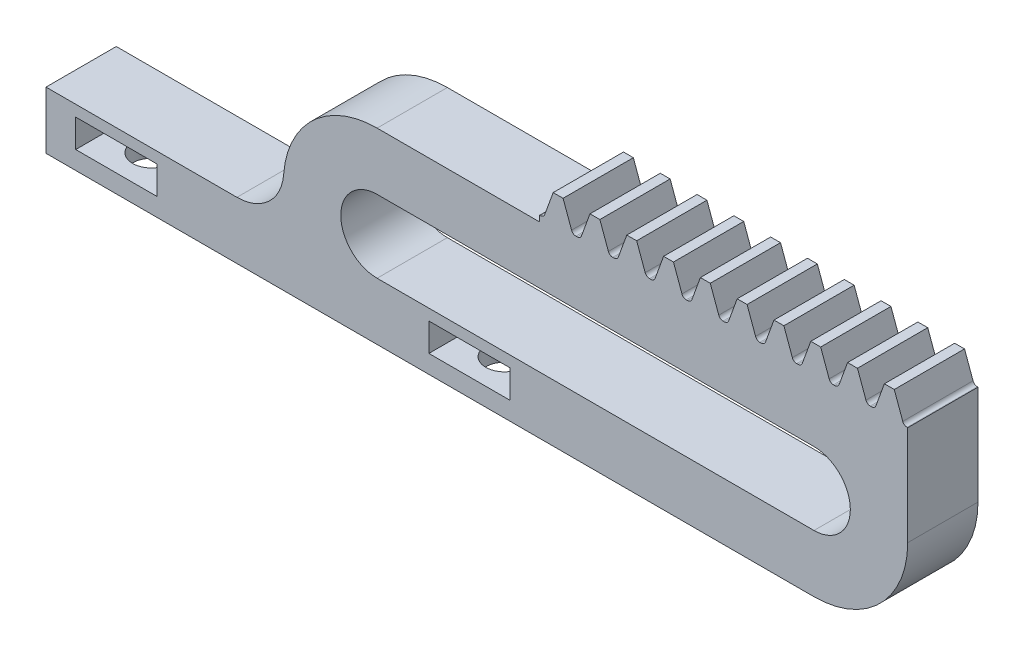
ISO-10303-21;
HEADER;
FILE_DESCRIPTION(('STEP AP214'),'2;1');
FILE_NAME('part.step','',(''),(''),'','','');
FILE_SCHEMA(('AUTOMOTIVE_DESIGN { 1 0 10303 214 1 1 1 1 }'));
ENDSEC;
DATA;
#1=APPLICATION_CONTEXT('core data for automotive mechanical design processes');
#2=APPLICATION_PROTOCOL_DEFINITION('international standard','automotive_design',2000,#1);
#3=PRODUCT_CONTEXT('',#1,'mechanical');
#4=PRODUCT('Part','Part','',(#3));
#5=PRODUCT_RELATED_PRODUCT_CATEGORY('part','',(#4));
#6=PRODUCT_DEFINITION_FORMATION('','',#4);
#7=PRODUCT_DEFINITION_CONTEXT('part definition',#1,'design');
#8=PRODUCT_DEFINITION('design','',#6,#7);
#9=PRODUCT_DEFINITION_SHAPE('','',#8);
#10=(LENGTH_UNIT() NAMED_UNIT(*) SI_UNIT(.MILLI.,.METRE.));
#11=(NAMED_UNIT(*) PLANE_ANGLE_UNIT() SI_UNIT($,.RADIAN.));
#12=(NAMED_UNIT(*) SI_UNIT($,.STERADIAN.) SOLID_ANGLE_UNIT());
#13=UNCERTAINTY_MEASURE_WITH_UNIT(LENGTH_MEASURE(1.E-05),#10,'distance_accuracy_value','');
#14=(GEOMETRIC_REPRESENTATION_CONTEXT(3) GLOBAL_UNCERTAINTY_ASSIGNED_CONTEXT((#13)) GLOBAL_UNIT_ASSIGNED_CONTEXT((#10,
#11,#12)) REPRESENTATION_CONTEXT('',''));
#15=CARTESIAN_POINT('',(0.,0.,0.));
#16=DIRECTION('',(0.,0.,1.));
#17=DIRECTION('',(1.,0.,0.));
#18=AXIS2_PLACEMENT_3D('',#15,#16,#17);
#19=CARTESIAN_POINT('',(-1.570796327,18.75,6.));
#20=DIRECTION('',(0.,0.,-1.));
#21=DIRECTION('',(-1.,0.,0.));
#22=AXIS2_PLACEMENT_3D('',#19,#20,#21);
#23=PLANE('',#22);
#24=DIRECTION('',(0.,1.,0.));
#25=VECTOR('',#24,1.);
#26=CARTESIAN_POINT('',(-4.10669471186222,1.55,6.));
#27=LINE('',#26,#25);
#28=CARTESIAN_POINT('',(-4.10669471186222,1.55,6.));
#29=VERTEX_POINT('',#28);
#30=CARTESIAN_POINT('',(-4.10669471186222,3.95,6.));
#31=VERTEX_POINT('',#30);
#32=EDGE_CURVE('E626',#29,#31,#27,.T.);
#33=ORIENTED_EDGE('',*,*,#32,.F.);
#34=DIRECTION('',(1.,0.,0.));
#35=VECTOR('',#34,1.);
#36=CARTESIAN_POINT('',(-4.10669471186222,1.55,6.));
#37=LINE('',#36,#35);
#38=CARTESIAN_POINT('',(-11.0348979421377,1.55,6.));
#39=VERTEX_POINT('',#38);
#40=EDGE_CURVE('E585',#39,#29,#37,.T.);
#41=ORIENTED_EDGE('',*,*,#40,.F.);
#42=DIRECTION('',(0.,1.,0.));
#43=VECTOR('',#42,1.);
#44=CARTESIAN_POINT('',(-11.0348979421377,1.55,6.));
#45=LINE('',#44,#43);
#46=CARTESIAN_POINT('',(-11.0348979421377,3.95,6.));
#47=VERTEX_POINT('',#46);
#48=EDGE_CURVE('E575',#39,#47,#45,.T.);
#49=ORIENTED_EDGE('',*,*,#48,.T.);
#50=DIRECTION('',(1.,0.,0.));
#51=VECTOR('',#50,1.);
#52=CARTESIAN_POINT('',(-4.10669471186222,3.95,6.));
#53=LINE('',#52,#51);
#54=EDGE_CURVE('E611',#47,#31,#53,.T.);
#55=ORIENTED_EDGE('',*,*,#54,.T.);
#56=EDGE_LOOP('',(#33,#41,#49,#55));
#57=FACE_BOUND('',#56,.T.);
#58=DIRECTION('',(1.,0.,0.));
#59=VECTOR('',#58,1.);
#60=CARTESIAN_POINT('',(-1.570796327,0.,6.));
#61=LINE('',#60,#59);
#62=CARTESIAN_POINT('',(-43.720796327,0.,6.));
#63=VERTEX_POINT('',#62);
#64=CARTESIAN_POINT('',(21.845130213,0.,6.));
#65=VERTEX_POINT('',#64);
#66=EDGE_CURVE('E1265',#63,#65,#61,.T.);
#67=ORIENTED_EDGE('',*,*,#66,.T.);
#68=CARTESIAN_POINT('',(21.845130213,8.,6.));
#69=DIRECTION('',(0.,0.,-1.));
#70=DIRECTION('',(-1.,0.,0.));
#71=AXIS2_PLACEMENT_3D('',#68,#69,#70);
#72=CIRCLE('',#71,8.);
#73=CARTESIAN_POINT('',(29.845130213,8.,6.));
#74=VERTEX_POINT('',#73);
#75=EDGE_CURVE('E11',#65,#74,#72,.F.);
#76=ORIENTED_EDGE('',*,*,#75,.T.);
#77=DIRECTION('',(0.,1.,0.));
#78=VECTOR('',#77,1.);
#79=CARTESIAN_POINT('',(29.845130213,0.,6.));
#80=LINE('',#79,#78);
#81=CARTESIAN_POINT('',(29.845130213,16.5,6.));
#82=VERTEX_POINT('',#81);
#83=EDGE_CURVE('E740',#74,#82,#80,.T.);
#84=ORIENTED_EDGE('',*,*,#83,.T.);
#85=DIRECTION('',(-1.,0.,0.));
#86=VECTOR('',#85,1.);
#87=CARTESIAN_POINT('',(29.845130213,16.5,6.));
#88=LINE('',#87,#86);
#89=CARTESIAN_POINT('',(29.7877757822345,16.5,6.));
#90=VERTEX_POINT('',#89);
#91=EDGE_CURVE('E1537',#82,#90,#88,.T.);
#92=ORIENTED_EDGE('',*,*,#91,.T.);
#93=CARTESIAN_POINT('',(29.7877757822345,16.89,6.));
#94=DIRECTION('',(0.,0.,1.));
#95=DIRECTION('',(1.,0.,0.));
#96=AXIS2_PLACEMENT_3D('',#93,#94,#95);
#97=CIRCLE('',#96,0.39);
#98=CARTESIAN_POINT('',(29.421295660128,16.756612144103,6.));
#99=VERTEX_POINT('',#98);
#100=EDGE_CURVE('E805',#99,#90,#97,.T.);
#101=ORIENTED_EDGE('',*,*,#100,.F.);
#102=DIRECTION('',(-0.342020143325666,0.93969262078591,0.));
#103=VECTOR('',#102,1.);
#104=CARTESIAN_POINT('',(29.5146948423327,16.5,6.));
#105=LINE('',#104,#103);
#106=CARTESIAN_POINT('',(28.6957618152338,18.75,6.));
#107=VERTEX_POINT('',#106);
#108=EDGE_CURVE('E788',#99,#107,#105,.T.);
#109=ORIENTED_EDGE('',*,*,#108,.T.);
#110=DIRECTION('',(1.,0.,0.));
#111=VECTOR('',#110,1.);
#112=CARTESIAN_POINT('',(27.8529059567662,18.75,6.));
#113=LINE('',#112,#111);
#114=CARTESIAN_POINT('',(27.8529059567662,18.75,6.));
#115=VERTEX_POINT('',#114);
#116=EDGE_CURVE('E810',#115,#107,#113,.T.);
#117=ORIENTED_EDGE('',*,*,#116,.F.);
#118=DIRECTION('',(0.342020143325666,0.93969262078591,0.));
#119=VECTOR('',#118,1.);
#120=CARTESIAN_POINT('',(27.0339729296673,16.5,6.));
#121=LINE('',#120,#119);
#122=CARTESIAN_POINT('',(27.127372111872,16.756612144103,6.));
#123=VERTEX_POINT('',#122);
#124=EDGE_CURVE('E808',#123,#115,#121,.T.);
#125=ORIENTED_EDGE('',*,*,#124,.F.);
#126=CARTESIAN_POINT('',(26.7608919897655,16.89,6.));
#127=DIRECTION('',(0.,0.,-1.));
#128=DIRECTION('',(-1.,0.,0.));
#129=AXIS2_PLACEMENT_3D('',#126,#127,#128);
#130=CIRCLE('',#129,0.39);
#131=CARTESIAN_POINT('',(26.7608919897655,16.5,6.));
#132=VERTEX_POINT('',#131);
#133=EDGE_CURVE('E825',#123,#132,#130,.T.);
#134=ORIENTED_EDGE('',*,*,#133,.T.);
#135=DIRECTION('',(-1.,0.,0.));
#136=VECTOR('',#135,1.);
#137=CARTESIAN_POINT('',(26.703537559,16.5,6.));
#138=LINE('',#137,#136);
#139=CARTESIAN_POINT('',(26.6461831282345,16.5,6.));
#140=VERTEX_POINT('',#139);
#141=EDGE_CURVE('E829',#132,#140,#138,.T.);
#142=ORIENTED_EDGE('',*,*,#141,.T.);
#143=CARTESIAN_POINT('',(26.6461831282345,16.89,6.));
#144=DIRECTION('',(0.,0.,1.));
#145=DIRECTION('',(1.,0.,0.));
#146=AXIS2_PLACEMENT_3D('',#143,#144,#145);
#147=CIRCLE('',#146,0.39);
#148=CARTESIAN_POINT('',(26.279703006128,16.756612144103,6.));
#149=VERTEX_POINT('',#148);
#150=EDGE_CURVE('E851',#149,#140,#147,.T.);
#151=ORIENTED_EDGE('',*,*,#150,.F.);
#152=DIRECTION('',(-0.342020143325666,0.93969262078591,0.));
#153=VECTOR('',#152,1.);
#154=CARTESIAN_POINT('',(26.3731021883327,16.5,6.));
#155=LINE('',#154,#153);
#156=CARTESIAN_POINT('',(25.5541691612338,18.75,6.));
#157=VERTEX_POINT('',#156);
#158=EDGE_CURVE('E832',#149,#157,#155,.T.);
#159=ORIENTED_EDGE('',*,*,#158,.T.);
#160=DIRECTION('',(1.,0.,0.));
#161=VECTOR('',#160,1.);
#162=CARTESIAN_POINT('',(24.7113133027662,18.75,6.));
#163=LINE('',#162,#161);
#164=CARTESIAN_POINT('',(24.7113133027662,18.75,6.));
#165=VERTEX_POINT('',#164);
#166=EDGE_CURVE('E856',#165,#157,#163,.T.);
#167=ORIENTED_EDGE('',*,*,#166,.F.);
#168=DIRECTION('',(0.342020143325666,0.93969262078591,0.));
#169=VECTOR('',#168,1.);
#170=CARTESIAN_POINT('',(23.8923802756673,16.5,6.));
#171=LINE('',#170,#169);
#172=CARTESIAN_POINT('',(23.985779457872,16.756612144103,6.));
#173=VERTEX_POINT('',#172);
#174=EDGE_CURVE('E854',#173,#165,#171,.T.);
#175=ORIENTED_EDGE('',*,*,#174,.F.);
#176=CARTESIAN_POINT('',(23.6192993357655,16.89,6.));
#177=DIRECTION('',(0.,0.,-1.));
#178=DIRECTION('',(-1.,0.,0.));
#179=AXIS2_PLACEMENT_3D('',#176,#177,#178);
#180=CIRCLE('',#179,0.39);
#181=CARTESIAN_POINT('',(23.6192993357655,16.5,6.));
#182=VERTEX_POINT('',#181);
#183=EDGE_CURVE('E871',#173,#182,#180,.T.);
#184=ORIENTED_EDGE('',*,*,#183,.T.);
#185=DIRECTION('',(-1.,0.,0.));
#186=VECTOR('',#185,1.);
#187=CARTESIAN_POINT('',(23.561944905,16.5,6.));
#188=LINE('',#187,#186);
#189=CARTESIAN_POINT('',(23.5045904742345,16.5,6.));
#190=VERTEX_POINT('',#189);
#191=EDGE_CURVE('E875',#182,#190,#188,.T.);
#192=ORIENTED_EDGE('',*,*,#191,.T.);
#193=CARTESIAN_POINT('',(23.5045904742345,16.89,6.));
#194=DIRECTION('',(0.,0.,1.));
#195=DIRECTION('',(1.,0.,0.));
#196=AXIS2_PLACEMENT_3D('',#193,#194,#195);
#197=CIRCLE('',#196,0.39);
#198=CARTESIAN_POINT('',(23.138110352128,16.756612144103,6.));
#199=VERTEX_POINT('',#198);
#200=EDGE_CURVE('E897',#199,#190,#197,.T.);
#201=ORIENTED_EDGE('',*,*,#200,.F.);
#202=DIRECTION('',(-0.342020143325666,0.93969262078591,0.));
#203=VECTOR('',#202,1.);
#204=CARTESIAN_POINT('',(23.2315095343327,16.5,6.));
#205=LINE('',#204,#203);
#206=CARTESIAN_POINT('',(22.4125765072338,18.75,6.));
#207=VERTEX_POINT('',#206);
#208=EDGE_CURVE('E878',#199,#207,#205,.T.);
#209=ORIENTED_EDGE('',*,*,#208,.T.);
#210=DIRECTION('',(1.,0.,0.));
#211=VECTOR('',#210,1.);
#212=CARTESIAN_POINT('',(21.5697206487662,18.75,6.));
#213=LINE('',#212,#211);
#214=CARTESIAN_POINT('',(21.5697206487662,18.75,6.));
#215=VERTEX_POINT('',#214);
#216=EDGE_CURVE('E902',#215,#207,#213,.T.);
#217=ORIENTED_EDGE('',*,*,#216,.F.);
#218=DIRECTION('',(0.342020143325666,0.93969262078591,0.));
#219=VECTOR('',#218,1.);
#220=CARTESIAN_POINT('',(20.7507876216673,16.5,6.));
#221=LINE('',#220,#219);
#222=CARTESIAN_POINT('',(20.844186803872,16.756612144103,6.));
#223=VERTEX_POINT('',#222);
#224=EDGE_CURVE('E900',#223,#215,#221,.T.);
#225=ORIENTED_EDGE('',*,*,#224,.F.);
#226=CARTESIAN_POINT('',(20.4777066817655,16.89,6.));
#227=DIRECTION('',(0.,0.,-1.));
#228=DIRECTION('',(-1.,0.,0.));
#229=AXIS2_PLACEMENT_3D('',#226,#227,#228);
#230=CIRCLE('',#229,0.39);
#231=CARTESIAN_POINT('',(20.4777066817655,16.5,6.));
#232=VERTEX_POINT('',#231);
#233=EDGE_CURVE('E917',#223,#232,#230,.T.);
#234=ORIENTED_EDGE('',*,*,#233,.T.);
#235=DIRECTION('',(-1.,0.,0.));
#236=VECTOR('',#235,1.);
#237=CARTESIAN_POINT('',(20.420352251,16.5,6.));
#238=LINE('',#237,#236);
#239=CARTESIAN_POINT('',(20.3629978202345,16.5,6.));
#240=VERTEX_POINT('',#239);
#241=EDGE_CURVE('E921',#232,#240,#238,.T.);
#242=ORIENTED_EDGE('',*,*,#241,.T.);
#243=CARTESIAN_POINT('',(20.3629978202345,16.89,6.));
#244=DIRECTION('',(0.,0.,1.));
#245=DIRECTION('',(1.,0.,0.));
#246=AXIS2_PLACEMENT_3D('',#243,#244,#245);
#247=CIRCLE('',#246,0.39);
#248=CARTESIAN_POINT('',(19.996517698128,16.756612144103,6.));
#249=VERTEX_POINT('',#248);
#250=EDGE_CURVE('E943',#249,#240,#247,.T.);
#251=ORIENTED_EDGE('',*,*,#250,.F.);
#252=DIRECTION('',(-0.342020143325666,0.93969262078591,0.));
#253=VECTOR('',#252,1.);
#254=CARTESIAN_POINT('',(20.0899168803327,16.5,6.));
#255=LINE('',#254,#253);
#256=CARTESIAN_POINT('',(19.2709838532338,18.75,6.));
#257=VERTEX_POINT('',#256);
#258=EDGE_CURVE('E924',#249,#257,#255,.T.);
#259=ORIENTED_EDGE('',*,*,#258,.T.);
#260=DIRECTION('',(1.,0.,0.));
#261=VECTOR('',#260,1.);
#262=CARTESIAN_POINT('',(18.4281279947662,18.75,6.));
#263=LINE('',#262,#261);
#264=CARTESIAN_POINT('',(18.4281279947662,18.75,6.));
#265=VERTEX_POINT('',#264);
#266=EDGE_CURVE('E948',#265,#257,#263,.T.);
#267=ORIENTED_EDGE('',*,*,#266,.F.);
#268=DIRECTION('',(0.342020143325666,0.93969262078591,0.));
#269=VECTOR('',#268,1.);
#270=CARTESIAN_POINT('',(17.6091949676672,16.5,6.));
#271=LINE('',#270,#269);
#272=CARTESIAN_POINT('',(17.702594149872,16.756612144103,6.));
#273=VERTEX_POINT('',#272);
#274=EDGE_CURVE('E946',#273,#265,#271,.T.);
#275=ORIENTED_EDGE('',*,*,#274,.F.);
#276=CARTESIAN_POINT('',(17.3361140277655,16.89,6.));
#277=DIRECTION('',(0.,0.,-1.));
#278=DIRECTION('',(-1.,0.,0.));
#279=AXIS2_PLACEMENT_3D('',#276,#277,#278);
#280=CIRCLE('',#279,0.39);
#281=CARTESIAN_POINT('',(17.3361140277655,16.5,6.));
#282=VERTEX_POINT('',#281);
#283=EDGE_CURVE('E963',#273,#282,#280,.T.);
#284=ORIENTED_EDGE('',*,*,#283,.T.);
#285=DIRECTION('',(-1.,0.,0.));
#286=VECTOR('',#285,1.);
#287=CARTESIAN_POINT('',(17.278759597,16.5,6.));
#288=LINE('',#287,#286);
#289=CARTESIAN_POINT('',(17.2214051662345,16.5,6.));
#290=VERTEX_POINT('',#289);
#291=EDGE_CURVE('E967',#282,#290,#288,.T.);
#292=ORIENTED_EDGE('',*,*,#291,.T.);
#293=CARTESIAN_POINT('',(17.2214051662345,16.89,6.));
#294=DIRECTION('',(0.,0.,1.));
#295=DIRECTION('',(1.,0.,0.));
#296=AXIS2_PLACEMENT_3D('',#293,#294,#295);
#297=CIRCLE('',#296,0.39);
#298=CARTESIAN_POINT('',(16.854925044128,16.756612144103,6.));
#299=VERTEX_POINT('',#298);
#300=EDGE_CURVE('E989',#299,#290,#297,.T.);
#301=ORIENTED_EDGE('',*,*,#300,.F.);
#302=DIRECTION('',(-0.342020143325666,0.93969262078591,0.));
#303=VECTOR('',#302,1.);
#304=CARTESIAN_POINT('',(16.9483242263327,16.5,6.));
#305=LINE('',#304,#303);
#306=CARTESIAN_POINT('',(16.1293911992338,18.75,6.));
#307=VERTEX_POINT('',#306);
#308=EDGE_CURVE('E970',#299,#307,#305,.T.);
#309=ORIENTED_EDGE('',*,*,#308,.T.);
#310=DIRECTION('',(1.,0.,0.));
#311=VECTOR('',#310,1.);
#312=CARTESIAN_POINT('',(15.2865353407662,18.75,6.));
#313=LINE('',#312,#311);
#314=CARTESIAN_POINT('',(15.2865353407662,18.75,6.));
#315=VERTEX_POINT('',#314);
#316=EDGE_CURVE('E994',#315,#307,#313,.T.);
#317=ORIENTED_EDGE('',*,*,#316,.F.);
#318=DIRECTION('',(0.342020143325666,0.93969262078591,0.));
#319=VECTOR('',#318,1.);
#320=CARTESIAN_POINT('',(14.4676023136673,16.5,6.));
#321=LINE('',#320,#319);
#322=CARTESIAN_POINT('',(14.561001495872,16.756612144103,6.));
#323=VERTEX_POINT('',#322);
#324=EDGE_CURVE('E992',#323,#315,#321,.T.);
#325=ORIENTED_EDGE('',*,*,#324,.F.);
#326=CARTESIAN_POINT('',(14.1945213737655,16.89,6.));
#327=DIRECTION('',(0.,0.,-1.));
#328=DIRECTION('',(-1.,0.,0.));
#329=AXIS2_PLACEMENT_3D('',#326,#327,#328);
#330=CIRCLE('',#329,0.39);
#331=CARTESIAN_POINT('',(14.1945213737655,16.5,6.));
#332=VERTEX_POINT('',#331);
#333=EDGE_CURVE('E1009',#323,#332,#330,.T.);
#334=ORIENTED_EDGE('',*,*,#333,.T.);
#335=DIRECTION('',(-1.,0.,0.));
#336=VECTOR('',#335,1.);
#337=CARTESIAN_POINT('',(14.137166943,16.5,6.));
#338=LINE('',#337,#336);
#339=CARTESIAN_POINT('',(14.0798125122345,16.5,6.));
#340=VERTEX_POINT('',#339);
#341=EDGE_CURVE('E1013',#332,#340,#338,.T.);
#342=ORIENTED_EDGE('',*,*,#341,.T.);
#343=CARTESIAN_POINT('',(14.0798125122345,16.89,6.));
#344=DIRECTION('',(0.,0.,1.));
#345=DIRECTION('',(1.,0.,0.));
#346=AXIS2_PLACEMENT_3D('',#343,#344,#345);
#347=CIRCLE('',#346,0.39);
#348=CARTESIAN_POINT('',(13.713332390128,16.756612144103,6.));
#349=VERTEX_POINT('',#348);
#350=EDGE_CURVE('E1035',#349,#340,#347,.T.);
#351=ORIENTED_EDGE('',*,*,#350,.F.);
#352=DIRECTION('',(-0.342020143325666,0.93969262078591,0.));
#353=VECTOR('',#352,1.);
#354=CARTESIAN_POINT('',(13.8067315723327,16.5,6.));
#355=LINE('',#354,#353);
#356=CARTESIAN_POINT('',(12.9877985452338,18.75,6.));
#357=VERTEX_POINT('',#356);
#358=EDGE_CURVE('E1016',#349,#357,#355,.T.);
#359=ORIENTED_EDGE('',*,*,#358,.T.);
#360=DIRECTION('',(1.,0.,0.));
#361=VECTOR('',#360,1.);
#362=CARTESIAN_POINT('',(12.1449426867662,18.75,6.));
#363=LINE('',#362,#361);
#364=CARTESIAN_POINT('',(12.1449426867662,18.75,6.));
#365=VERTEX_POINT('',#364);
#366=EDGE_CURVE('E1040',#365,#357,#363,.T.);
#367=ORIENTED_EDGE('',*,*,#366,.F.);
#368=DIRECTION('',(0.342020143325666,0.93969262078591,0.));
#369=VECTOR('',#368,1.);
#370=CARTESIAN_POINT('',(11.3260096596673,16.5,6.));
#371=LINE('',#370,#369);
#372=CARTESIAN_POINT('',(11.419408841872,16.756612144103,6.));
#373=VERTEX_POINT('',#372);
#374=EDGE_CURVE('E1038',#373,#365,#371,.T.);
#375=ORIENTED_EDGE('',*,*,#374,.F.);
#376=CARTESIAN_POINT('',(11.0529287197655,16.89,6.));
#377=DIRECTION('',(0.,0.,-1.));
#378=DIRECTION('',(-1.,0.,0.));
#379=AXIS2_PLACEMENT_3D('',#376,#377,#378);
#380=CIRCLE('',#379,0.39);
#381=CARTESIAN_POINT('',(11.0529287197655,16.5,6.));
#382=VERTEX_POINT('',#381);
#383=EDGE_CURVE('E1055',#373,#382,#380,.T.);
#384=ORIENTED_EDGE('',*,*,#383,.T.);
#385=DIRECTION('',(-1.,0.,0.));
#386=VECTOR('',#385,1.);
#387=CARTESIAN_POINT('',(10.995574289,16.5,6.));
#388=LINE('',#387,#386);
#389=CARTESIAN_POINT('',(10.9382198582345,16.5,6.));
#390=VERTEX_POINT('',#389);
#391=EDGE_CURVE('E1059',#382,#390,#388,.T.);
#392=ORIENTED_EDGE('',*,*,#391,.T.);
#393=CARTESIAN_POINT('',(10.9382198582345,16.89,6.));
#394=DIRECTION('',(0.,0.,1.));
#395=DIRECTION('',(1.,0.,0.));
#396=AXIS2_PLACEMENT_3D('',#393,#394,#395);
#397=CIRCLE('',#396,0.39);
#398=CARTESIAN_POINT('',(10.571739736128,16.756612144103,6.));
#399=VERTEX_POINT('',#398);
#400=EDGE_CURVE('E1081',#399,#390,#397,.T.);
#401=ORIENTED_EDGE('',*,*,#400,.F.);
#402=DIRECTION('',(-0.342020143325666,0.93969262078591,0.));
#403=VECTOR('',#402,1.);
#404=CARTESIAN_POINT('',(10.6651389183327,16.5,6.));
#405=LINE('',#404,#403);
#406=CARTESIAN_POINT('',(9.8462058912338,18.75,6.));
#407=VERTEX_POINT('',#406);
#408=EDGE_CURVE('E1062',#399,#407,#405,.T.);
#409=ORIENTED_EDGE('',*,*,#408,.T.);
#410=DIRECTION('',(1.,0.,0.));
#411=VECTOR('',#410,1.);
#412=CARTESIAN_POINT('',(9.0033500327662,18.75,6.));
#413=LINE('',#412,#411);
#414=CARTESIAN_POINT('',(9.0033500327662,18.75,6.));
#415=VERTEX_POINT('',#414);
#416=EDGE_CURVE('E1086',#415,#407,#413,.T.);
#417=ORIENTED_EDGE('',*,*,#416,.F.);
#418=DIRECTION('',(0.342020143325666,0.93969262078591,0.));
#419=VECTOR('',#418,1.);
#420=CARTESIAN_POINT('',(8.18441700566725,16.5,6.));
#421=LINE('',#420,#419);
#422=CARTESIAN_POINT('',(8.27781618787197,16.756612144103,6.));
#423=VERTEX_POINT('',#422);
#424=EDGE_CURVE('E1084',#423,#415,#421,.T.);
#425=ORIENTED_EDGE('',*,*,#424,.F.);
#426=CARTESIAN_POINT('',(7.91133606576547,16.89,6.));
#427=DIRECTION('',(0.,0.,-1.));
#428=DIRECTION('',(-1.,0.,0.));
#429=AXIS2_PLACEMENT_3D('',#426,#427,#428);
#430=CIRCLE('',#429,0.39);
#431=CARTESIAN_POINT('',(7.91133606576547,16.5,6.));
#432=VERTEX_POINT('',#431);
#433=EDGE_CURVE('E1101',#423,#432,#430,.T.);
#434=ORIENTED_EDGE('',*,*,#433,.T.);
#435=DIRECTION('',(-1.,0.,0.));
#436=VECTOR('',#435,1.);
#437=CARTESIAN_POINT('',(7.853981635,16.5,6.));
#438=LINE('',#437,#436);
#439=CARTESIAN_POINT('',(7.79662720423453,16.5,6.));
#440=VERTEX_POINT('',#439);
#441=EDGE_CURVE('E1105',#432,#440,#438,.T.);
#442=ORIENTED_EDGE('',*,*,#441,.T.);
#443=CARTESIAN_POINT('',(7.79662720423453,16.89,6.));
#444=DIRECTION('',(0.,0.,1.));
#445=DIRECTION('',(1.,0.,0.));
#446=AXIS2_PLACEMENT_3D('',#443,#444,#445);
#447=CIRCLE('',#446,0.39);
#448=CARTESIAN_POINT('',(7.43014708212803,16.756612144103,6.));
#449=VERTEX_POINT('',#448);
#450=EDGE_CURVE('E1127',#449,#440,#447,.T.);
#451=ORIENTED_EDGE('',*,*,#450,.F.);
#452=DIRECTION('',(-0.342020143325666,0.93969262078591,0.));
#453=VECTOR('',#452,1.);
#454=CARTESIAN_POINT('',(7.52354626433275,16.5,6.));
#455=LINE('',#454,#453);
#456=CARTESIAN_POINT('',(6.7046132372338,18.75,6.));
#457=VERTEX_POINT('',#456);
#458=EDGE_CURVE('E1108',#449,#457,#455,.T.);
#459=ORIENTED_EDGE('',*,*,#458,.T.);
#460=DIRECTION('',(1.,0.,0.));
#461=VECTOR('',#460,1.);
#462=CARTESIAN_POINT('',(5.8617573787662,18.75,6.));
#463=LINE('',#462,#461);
#464=CARTESIAN_POINT('',(5.8617573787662,18.75,6.));
#465=VERTEX_POINT('',#464);
#466=EDGE_CURVE('E1132',#465,#457,#463,.T.);
#467=ORIENTED_EDGE('',*,*,#466,.F.);
#468=DIRECTION('',(0.342020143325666,0.93969262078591,0.));
#469=VECTOR('',#468,1.);
#470=CARTESIAN_POINT('',(5.04282435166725,16.5,6.));
#471=LINE('',#470,#469);
#472=CARTESIAN_POINT('',(5.13622353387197,16.756612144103,6.));
#473=VERTEX_POINT('',#472);
#474=EDGE_CURVE('E1130',#473,#465,#471,.T.);
#475=ORIENTED_EDGE('',*,*,#474,.F.);
#476=CARTESIAN_POINT('',(4.76974341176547,16.89,6.));
#477=DIRECTION('',(0.,0.,-1.));
#478=DIRECTION('',(-1.,0.,0.));
#479=AXIS2_PLACEMENT_3D('',#476,#477,#478);
#480=CIRCLE('',#479,0.39);
#481=CARTESIAN_POINT('',(4.76974341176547,16.5,6.));
#482=VERTEX_POINT('',#481);
#483=EDGE_CURVE('E1147',#473,#482,#480,.T.);
#484=ORIENTED_EDGE('',*,*,#483,.T.);
#485=DIRECTION('',(-1.,0.,0.));
#486=VECTOR('',#485,1.);
#487=CARTESIAN_POINT('',(4.712388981,16.5,6.));
#488=LINE('',#487,#486);
#489=CARTESIAN_POINT('',(4.65503455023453,16.5,6.));
#490=VERTEX_POINT('',#489);
#491=EDGE_CURVE('E1151',#482,#490,#488,.T.);
#492=ORIENTED_EDGE('',*,*,#491,.T.);
#493=CARTESIAN_POINT('',(4.65503455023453,16.89,6.));
#494=DIRECTION('',(0.,0.,1.));
#495=DIRECTION('',(1.,0.,0.));
#496=AXIS2_PLACEMENT_3D('',#493,#494,#495);
#497=CIRCLE('',#496,0.39);
#498=CARTESIAN_POINT('',(4.28855442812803,16.756612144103,6.));
#499=VERTEX_POINT('',#498);
#500=EDGE_CURVE('E1173',#499,#490,#497,.T.);
#501=ORIENTED_EDGE('',*,*,#500,.F.);
#502=DIRECTION('',(-0.342020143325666,0.93969262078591,0.));
#503=VECTOR('',#502,1.);
#504=CARTESIAN_POINT('',(4.38195361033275,16.5,6.));
#505=LINE('',#504,#503);
#506=CARTESIAN_POINT('',(3.5630205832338,18.75,6.));
#507=VERTEX_POINT('',#506);
#508=EDGE_CURVE('E1154',#499,#507,#505,.T.);
#509=ORIENTED_EDGE('',*,*,#508,.T.);
#510=DIRECTION('',(1.,0.,0.));
#511=VECTOR('',#510,1.);
#512=CARTESIAN_POINT('',(2.7201647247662,18.75,6.));
#513=LINE('',#512,#511);
#514=CARTESIAN_POINT('',(2.7201647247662,18.75,6.));
#515=VERTEX_POINT('',#514);
#516=EDGE_CURVE('E1178',#515,#507,#513,.T.);
#517=ORIENTED_EDGE('',*,*,#516,.F.);
#518=DIRECTION('',(0.342020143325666,0.93969262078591,0.));
#519=VECTOR('',#518,1.);
#520=CARTESIAN_POINT('',(1.90123169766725,16.5,6.));
#521=LINE('',#520,#519);
#522=CARTESIAN_POINT('',(1.99463087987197,16.756612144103,6.));
#523=VERTEX_POINT('',#522);
#524=EDGE_CURVE('E1176',#523,#515,#521,.T.);
#525=ORIENTED_EDGE('',*,*,#524,.F.);
#526=CARTESIAN_POINT('',(1.62815075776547,16.89,6.));
#527=DIRECTION('',(0.,0.,-1.));
#528=DIRECTION('',(-1.,0.,0.));
#529=AXIS2_PLACEMENT_3D('',#526,#527,#528);
#530=CIRCLE('',#529,0.39);
#531=CARTESIAN_POINT('',(1.62815075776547,16.5,6.));
#532=VERTEX_POINT('',#531);
#533=EDGE_CURVE('E1193',#523,#532,#530,.T.);
#534=ORIENTED_EDGE('',*,*,#533,.T.);
#535=DIRECTION('',(-1.,0.,0.));
#536=VECTOR('',#535,1.);
#537=CARTESIAN_POINT('',(1.570796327,16.5,6.));
#538=LINE('',#537,#536);
#539=CARTESIAN_POINT('',(1.51344189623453,16.5,6.));
#540=VERTEX_POINT('',#539);
#541=EDGE_CURVE('E1197',#532,#540,#538,.T.);
#542=ORIENTED_EDGE('',*,*,#541,.T.);
#543=CARTESIAN_POINT('',(1.51344189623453,16.89,6.));
#544=DIRECTION('',(0.,0.,1.));
#545=DIRECTION('',(1.,0.,0.));
#546=AXIS2_PLACEMENT_3D('',#543,#544,#545);
#547=CIRCLE('',#546,0.39);
#548=CARTESIAN_POINT('',(1.14696177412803,16.756612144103,6.));
#549=VERTEX_POINT('',#548);
#550=EDGE_CURVE('E1219',#549,#540,#547,.T.);
#551=ORIENTED_EDGE('',*,*,#550,.F.);
#552=DIRECTION('',(-0.342020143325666,0.93969262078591,0.));
#553=VECTOR('',#552,1.);
#554=CARTESIAN_POINT('',(1.24036095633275,16.5,6.));
#555=LINE('',#554,#553);
#556=CARTESIAN_POINT('',(0.421427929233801,18.75,6.));
#557=VERTEX_POINT('',#556);
#558=EDGE_CURVE('E1200',#549,#557,#555,.T.);
#559=ORIENTED_EDGE('',*,*,#558,.T.);
#560=DIRECTION('',(1.,0.,0.));
#561=VECTOR('',#560,1.);
#562=CARTESIAN_POINT('',(-0.421427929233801,18.75,6.));
#563=LINE('',#562,#561);
#564=CARTESIAN_POINT('',(-0.421427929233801,18.75,6.));
#565=VERTEX_POINT('',#564);
#566=EDGE_CURVE('E1785',#565,#557,#563,.T.);
#567=ORIENTED_EDGE('',*,*,#566,.F.);
#568=DIRECTION('',(0.342020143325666,0.93969262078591,0.));
#569=VECTOR('',#568,1.);
#570=CARTESIAN_POINT('',(-1.24036095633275,16.5,6.));
#571=LINE('',#570,#569);
#572=CARTESIAN_POINT('',(-1.14696177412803,16.756612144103,6.));
#573=VERTEX_POINT('',#572);
#574=EDGE_CURVE('E1275',#573,#565,#571,.T.);
#575=ORIENTED_EDGE('',*,*,#574,.F.);
#576=CARTESIAN_POINT('',(-1.51344189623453,16.89,6.));
#577=DIRECTION('',(0.,0.,-1.));
#578=DIRECTION('',(-1.,0.,0.));
#579=AXIS2_PLACEMENT_3D('',#576,#577,#578);
#580=CIRCLE('',#579,0.39);
#581=CARTESIAN_POINT('',(-1.51344189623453,16.5,6.));
#582=VERTEX_POINT('',#581);
#583=EDGE_CURVE('E762',#573,#582,#580,.T.);
#584=ORIENTED_EDGE('',*,*,#583,.T.);
#585=DIRECTION('',(1.,0.,0.));
#586=VECTOR('',#585,1.);
#587=CARTESIAN_POINT('',(-1.570796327,16.5,6.));
#588=LINE('',#587,#586);
#589=CARTESIAN_POINT('',(-1.570796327,16.5,6.));
#590=VERTEX_POINT('',#589);
#591=EDGE_CURVE('E1224',#590,#582,#588,.T.);
#592=ORIENTED_EDGE('',*,*,#591,.F.);
#593=DIRECTION('',(0.,1.,0.));
#594=VECTOR('',#593,1.);
#595=CARTESIAN_POINT('',(-1.570796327,0.,6.));
#596=LINE('',#595,#594);
#597=CARTESIAN_POINT('',(-1.570796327,16.,6.));
#598=VERTEX_POINT('',#597);
#599=EDGE_CURVE('E1227',#598,#590,#596,.T.);
#600=ORIENTED_EDGE('',*,*,#599,.F.);
#601=DIRECTION('',(-1.,0.,0.));
#602=VECTOR('',#601,1.);
#603=CARTESIAN_POINT('',(-43.720796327,16.,6.));
#604=LINE('',#603,#602);
#605=CARTESIAN_POINT('',(-15.454869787,16.,6.));
#606=VERTEX_POINT('',#605);
#607=EDGE_CURVE('E721',#598,#606,#604,.T.);
#608=ORIENTED_EDGE('',*,*,#607,.T.);
#609=CARTESIAN_POINT('',(-15.454869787,7.99999999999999,6.));
#610=DIRECTION('',(0.,0.,-1.));
#611=DIRECTION('',(1.,0.,0.));
#612=AXIS2_PLACEMENT_3D('',#609,#610,#611);
#613=CIRCLE('',#612,8.);
#614=CARTESIAN_POINT('',(-23.4323380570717,8.59999999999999,6.));
#615=VERTEX_POINT('',#614);
#616=EDGE_CURVE('E668',#615,#606,#613,.T.);
#617=ORIENTED_EDGE('',*,*,#616,.F.);
#618=CARTESIAN_POINT('',(-27.4210721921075,8.89999999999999,6.));
#619=DIRECTION('',(0.,0.,-1.));
#620=DIRECTION('',(-1.,0.,0.));
#621=AXIS2_PLACEMENT_3D('',#618,#619,#620);
#622=CIRCLE('',#621,4.);
#623=CARTESIAN_POINT('',(-27.4210721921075,4.89999999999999,6.));
#624=VERTEX_POINT('',#623);
#625=EDGE_CURVE('E764',#615,#624,#622,.T.);
#626=ORIENTED_EDGE('',*,*,#625,.T.);
#627=DIRECTION('',(1.,0.,0.));
#628=VECTOR('',#627,1.);
#629=CARTESIAN_POINT('',(-43.720796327,4.89999999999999,6.));
#630=LINE('',#629,#628);
#631=CARTESIAN_POINT('',(-43.720796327,4.89999999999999,6.));
#632=VERTEX_POINT('',#631);
#633=EDGE_CURVE('E684',#632,#624,#630,.T.);
#634=ORIENTED_EDGE('',*,*,#633,.F.);
#635=DIRECTION('',(0.,-1.,0.));
#636=VECTOR('',#635,1.);
#637=CARTESIAN_POINT('',(-43.720796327,16.,6.));
#638=LINE('',#637,#636);
#639=EDGE_CURVE('E732',#632,#63,#638,.T.);
#640=ORIENTED_EDGE('',*,*,#639,.T.);
#641=EDGE_LOOP('',(#67,#76,#84,#92,#101,#109,#117,#125,#134,#142,#151,#159,#167,#175,#184,#192,
#201,#209,#217,#225,#234,#242,#251,#259,#267,#275,#284,#292,#301,#309,#317,#325,#334,#342,#351,
#359,#367,#375,#384,#392,#401,#409,#417,#425,#434,#442,#451,#459,#467,#475,#484,#492,#501,#509,
#517,#525,#534,#542,#551,#559,#567,#575,#584,#592,#600,#608,#617,#626,#634,#640));
#642=FACE_BOUND('',#641,.T.);
#643=DIRECTION('',(1.,0.,0.));
#644=VECTOR('',#643,1.);
#645=CARTESIAN_POINT('',(-15.454869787,4.89999999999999,6.));
#646=LINE('',#645,#644);
#647=CARTESIAN_POINT('',(-15.454869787,4.89999999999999,6.));
#648=VERTEX_POINT('',#647);
#649=CARTESIAN_POINT('',(21.845130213,4.89999999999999,6.));
#650=VERTEX_POINT('',#649);
#651=EDGE_CURVE('E711',#648,#650,#646,.T.);
#652=ORIENTED_EDGE('',*,*,#651,.F.);
#653=CARTESIAN_POINT('',(-15.454869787,7.99999999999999,6.));
#654=DIRECTION('',(0.,0.,1.));
#655=DIRECTION('',(1.,0.,0.));
#656=AXIS2_PLACEMENT_3D('',#653,#654,#655);
#657=CIRCLE('',#656,3.1);
#658=CARTESIAN_POINT('',(-15.454869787,11.1,6.));
#659=VERTEX_POINT('',#658);
#660=EDGE_CURVE('E693',#659,#648,#657,.T.);
#661=ORIENTED_EDGE('',*,*,#660,.F.);
#662=DIRECTION('',(-1.,0.,0.));
#663=VECTOR('',#662,1.);
#664=CARTESIAN_POINT('',(21.845130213,11.1,6.));
#665=LINE('',#664,#663);
#666=CARTESIAN_POINT('',(21.845130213,11.1,6.));
#667=VERTEX_POINT('',#666);
#668=EDGE_CURVE('E700',#667,#659,#665,.T.);
#669=ORIENTED_EDGE('',*,*,#668,.F.);
#670=CARTESIAN_POINT('',(21.845130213,7.99999999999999,6.));
#671=DIRECTION('',(0.,0.,1.));
#672=DIRECTION('',(1.,0.,0.));
#673=AXIS2_PLACEMENT_3D('',#670,#671,#672);
#674=CIRCLE('',#673,3.1);
#675=EDGE_CURVE('E714',#650,#667,#674,.T.);
#676=ORIENTED_EDGE('',*,*,#675,.F.);
#677=EDGE_LOOP('',(#652,#661,#669,#676));
#678=FACE_BOUND('',#677,.T.);
#679=DIRECTION('',(1.,0.,0.));
#680=VECTOR('',#679,1.);
#681=CARTESIAN_POINT('',(-41.1848979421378,1.55,6.00000000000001));
#682=LINE('',#681,#680);
#683=CARTESIAN_POINT('',(-41.1848979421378,1.55,6.00000000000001));
#684=VERTEX_POINT('',#683);
#685=CARTESIAN_POINT('',(-34.2566947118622,1.55,6.00000000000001));
#686=VERTEX_POINT('',#685);
#687=EDGE_CURVE('E646',#684,#686,#682,.T.);
#688=ORIENTED_EDGE('',*,*,#687,.F.);
#689=DIRECTION('',(0.,1.,0.));
#690=VECTOR('',#689,1.);
#691=CARTESIAN_POINT('',(-41.1848979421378,1.55,6.00000000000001));
#692=LINE('',#691,#690);
#693=CARTESIAN_POINT('',(-41.1848979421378,3.95,6.00000000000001));
#694=VERTEX_POINT('',#693);
#695=EDGE_CURVE('E669',#684,#694,#692,.T.);
#696=ORIENTED_EDGE('',*,*,#695,.T.);
#697=DIRECTION('',(1.,0.,0.));
#698=VECTOR('',#697,1.);
#699=CARTESIAN_POINT('',(-41.1848979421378,3.95,6.00000000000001));
#700=LINE('',#699,#698);
#701=CARTESIAN_POINT('',(-34.2566947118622,3.95,6.));
#702=VERTEX_POINT('',#701);
#703=EDGE_CURVE('E634',#694,#702,#700,.T.);
#704=ORIENTED_EDGE('',*,*,#703,.T.);
#705=DIRECTION('',(0.,1.,0.));
#706=VECTOR('',#705,1.);
#707=CARTESIAN_POINT('',(-34.2566947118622,1.55,6.00000000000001));
#708=LINE('',#707,#706);
#709=EDGE_CURVE('E665',#686,#702,#708,.T.);
#710=ORIENTED_EDGE('',*,*,#709,.F.);
#711=EDGE_LOOP('',(#688,#696,#704,#710));
#712=FACE_BOUND('',#711,.T.);
#713=ADVANCED_FACE('F32',(#57,#642,#678,#712),#23,.F.);
#714=CARTESIAN_POINT('',(-1.570796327,18.75,0.));
#715=DIRECTION('',(0.,0.,-1.));
#716=DIRECTION('',(-1.,0.,0.));
#717=AXIS2_PLACEMENT_3D('',#714,#715,#716);
#718=PLANE('',#717);
#719=DIRECTION('',(-1.,0.,0.));
#720=VECTOR('',#719,1.);
#721=CARTESIAN_POINT('',(-9.30284713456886,1.55,0.));
#722=LINE('',#721,#720);
#723=CARTESIAN_POINT('',(-5.8387455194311,1.55,0.));
#724=VERTEX_POINT('',#723);
#725=CARTESIAN_POINT('',(-9.30284713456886,1.55,0.));
#726=VERTEX_POINT('',#725);
#727=EDGE_CURVE('E576',#724,#726,#722,.T.);
#728=ORIENTED_EDGE('',*,*,#727,.F.);
#729=DIRECTION('',(0.,1.,0.));
#730=VECTOR('',#729,1.);
#731=CARTESIAN_POINT('',(-5.8387455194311,1.55,0.));
#732=LINE('',#731,#730);
#733=CARTESIAN_POINT('',(-5.8387455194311,3.95,0.));
#734=VERTEX_POINT('',#733);
#735=EDGE_CURVE('E621',#724,#734,#732,.T.);
#736=ORIENTED_EDGE('',*,*,#735,.T.);
#737=DIRECTION('',(-1.,0.,0.));
#738=VECTOR('',#737,1.);
#739=CARTESIAN_POINT('',(-9.30284713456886,3.95,0.));
#740=LINE('',#739,#738);
#741=CARTESIAN_POINT('',(-9.30284713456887,3.95,0.));
#742=VERTEX_POINT('',#741);
#743=EDGE_CURVE('E591',#734,#742,#740,.T.);
#744=ORIENTED_EDGE('',*,*,#743,.T.);
#745=DIRECTION('',(0.,1.,0.));
#746=VECTOR('',#745,1.);
#747=CARTESIAN_POINT('',(-9.30284713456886,1.55,0.));
#748=LINE('',#747,#746);
#749=EDGE_CURVE('E618',#726,#742,#748,.T.);
#750=ORIENTED_EDGE('',*,*,#749,.F.);
#751=EDGE_LOOP('',(#728,#736,#744,#750));
#752=FACE_BOUND('',#751,.T.);
#753=CARTESIAN_POINT('',(-15.454869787,7.99999999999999,0.));
#754=DIRECTION('',(0.,0.,1.));
#755=DIRECTION('',(1.,0.,0.));
#756=AXIS2_PLACEMENT_3D('',#753,#754,#755);
#757=CIRCLE('',#756,3.1);
#758=CARTESIAN_POINT('',(-15.454869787,11.1,0.));
#759=VERTEX_POINT('',#758);
#760=CARTESIAN_POINT('',(-15.454869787,4.89999999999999,0.));
#761=VERTEX_POINT('',#760);
#762=EDGE_CURVE('E696',#759,#761,#757,.T.);
#763=ORIENTED_EDGE('',*,*,#762,.T.);
#764=DIRECTION('',(1.,0.,0.));
#765=VECTOR('',#764,1.);
#766=CARTESIAN_POINT('',(-15.454869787,4.89999999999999,0.));
#767=LINE('',#766,#765);
#768=CARTESIAN_POINT('',(21.845130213,4.89999999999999,0.));
#769=VERTEX_POINT('',#768);
#770=EDGE_CURVE('E699',#761,#769,#767,.T.);
#771=ORIENTED_EDGE('',*,*,#770,.T.);
#772=CARTESIAN_POINT('',(21.845130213,7.99999999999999,0.));
#773=DIRECTION('',(0.,0.,1.));
#774=DIRECTION('',(1.,0.,0.));
#775=AXIS2_PLACEMENT_3D('',#772,#773,#774);
#776=CIRCLE('',#775,3.1);
#777=CARTESIAN_POINT('',(21.845130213,11.1,0.));
#778=VERTEX_POINT('',#777);
#779=EDGE_CURVE('E703',#769,#778,#776,.T.);
#780=ORIENTED_EDGE('',*,*,#779,.T.);
#781=DIRECTION('',(-1.,0.,0.));
#782=VECTOR('',#781,1.);
#783=CARTESIAN_POINT('',(21.845130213,11.1,0.));
#784=LINE('',#783,#782);
#785=EDGE_CURVE('E706',#778,#759,#784,.T.);
#786=ORIENTED_EDGE('',*,*,#785,.T.);
#787=EDGE_LOOP('',(#763,#771,#780,#786));
#788=FACE_BOUND('',#787,.T.);
#789=DIRECTION('',(0.,1.,0.));
#790=VECTOR('',#789,1.);
#791=CARTESIAN_POINT('',(29.845130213,0.,0.));
#792=LINE('',#791,#790);
#793=CARTESIAN_POINT('',(29.845130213,8.,0.));
#794=VERTEX_POINT('',#793);
#795=CARTESIAN_POINT('',(29.845130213,16.5,0.));
#796=VERTEX_POINT('',#795);
#797=EDGE_CURVE('E737',#794,#796,#792,.T.);
#798=ORIENTED_EDGE('',*,*,#797,.F.);
#799=CARTESIAN_POINT('',(21.845130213,8.,0.));
#800=DIRECTION('',(0.,0.,-1.));
#801=DIRECTION('',(-1.,0.,0.));
#802=AXIS2_PLACEMENT_3D('',#799,#800,#801);
#803=CIRCLE('',#802,8.);
#804=CARTESIAN_POINT('',(21.845130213,0.,0.));
#805=VERTEX_POINT('',#804);
#806=EDGE_CURVE('E54',#794,#805,#803,.T.);
#807=ORIENTED_EDGE('',*,*,#806,.T.);
#808=DIRECTION('',(1.,0.,0.));
#809=VECTOR('',#808,1.);
#810=CARTESIAN_POINT('',(-1.570796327,0.,0.));
#811=LINE('',#810,#809);
#812=CARTESIAN_POINT('',(-43.720796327,0.,0.));
#813=VERTEX_POINT('',#812);
#814=EDGE_CURVE('E1229',#813,#805,#811,.T.);
#815=ORIENTED_EDGE('',*,*,#814,.F.);
#816=DIRECTION('',(0.,-1.,0.));
#817=VECTOR('',#816,1.);
#818=CARTESIAN_POINT('',(-43.720796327,16.,0.));
#819=LINE('',#818,#817);
#820=CARTESIAN_POINT('',(-43.720796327,4.89999999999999,0.));
#821=VERTEX_POINT('',#820);
#822=EDGE_CURVE('E728',#821,#813,#819,.T.);
#823=ORIENTED_EDGE('',*,*,#822,.F.);
#824=DIRECTION('',(1.,0.,0.));
#825=VECTOR('',#824,1.);
#826=CARTESIAN_POINT('',(-43.720796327,4.89999999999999,0.));
#827=LINE('',#826,#825);
#828=CARTESIAN_POINT('',(-27.4210721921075,4.89999999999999,0.));
#829=VERTEX_POINT('',#828);
#830=EDGE_CURVE('E683',#821,#829,#827,.T.);
#831=ORIENTED_EDGE('',*,*,#830,.T.);
#832=CARTESIAN_POINT('',(-27.4210721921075,8.89999999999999,0.));
#833=DIRECTION('',(0.,0.,-1.));
#834=DIRECTION('',(-1.,0.,0.));
#835=AXIS2_PLACEMENT_3D('',#832,#833,#834);
#836=CIRCLE('',#835,4.);
#837=CARTESIAN_POINT('',(-23.4323380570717,8.59999999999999,0.));
#838=VERTEX_POINT('',#837);
#839=EDGE_CURVE('E766',#829,#838,#836,.F.);
#840=ORIENTED_EDGE('',*,*,#839,.T.);
#841=CARTESIAN_POINT('',(-15.454869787,7.99999999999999,0.));
#842=DIRECTION('',(0.,0.,-1.));
#843=DIRECTION('',(1.,0.,0.));
#844=AXIS2_PLACEMENT_3D('',#841,#842,#843);
#845=CIRCLE('',#844,8.);
#846=CARTESIAN_POINT('',(-15.454869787,16.,0.));
#847=VERTEX_POINT('',#846);
#848=EDGE_CURVE('E681',#838,#847,#845,.T.);
#849=ORIENTED_EDGE('',*,*,#848,.T.);
#850=DIRECTION('',(-1.,0.,0.));
#851=VECTOR('',#850,1.);
#852=CARTESIAN_POINT('',(-43.720796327,16.,0.));
#853=LINE('',#852,#851);
#854=CARTESIAN_POINT('',(-1.570796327,16.,0.));
#855=VERTEX_POINT('',#854);
#856=EDGE_CURVE('E731',#855,#847,#853,.T.);
#857=ORIENTED_EDGE('',*,*,#856,.F.);
#858=DIRECTION('',(0.,1.,0.));
#859=VECTOR('',#858,1.);
#860=CARTESIAN_POINT('',(-1.570796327,0.,0.));
#861=LINE('',#860,#859);
#862=CARTESIAN_POINT('',(-1.570796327,16.5,0.));
#863=VERTEX_POINT('',#862);
#864=EDGE_CURVE('E1221',#855,#863,#861,.T.);
#865=ORIENTED_EDGE('',*,*,#864,.T.);
#866=DIRECTION('',(1.,0.,0.));
#867=VECTOR('',#866,1.);
#868=CARTESIAN_POINT('',(-1.570796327,16.5,0.));
#869=LINE('',#868,#867);
#870=CARTESIAN_POINT('',(-1.51344189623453,16.5,0.));
#871=VERTEX_POINT('',#870);
#872=EDGE_CURVE('E1250',#863,#871,#869,.T.);
#873=ORIENTED_EDGE('',*,*,#872,.T.);
#874=CARTESIAN_POINT('',(-1.51344189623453,16.89,0.));
#875=DIRECTION('',(0.,0.,-1.));
#876=DIRECTION('',(-1.,0.,0.));
#877=AXIS2_PLACEMENT_3D('',#874,#875,#876);
#878=CIRCLE('',#877,0.39);
#879=CARTESIAN_POINT('',(-1.14696177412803,16.756612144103,0.));
#880=VERTEX_POINT('',#879);
#881=EDGE_CURVE('E1270',#871,#880,#878,.F.);
#882=ORIENTED_EDGE('',*,*,#881,.T.);
#883=DIRECTION('',(0.342020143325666,0.93969262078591,0.));
#884=VECTOR('',#883,1.);
#885=CARTESIAN_POINT('',(-1.24036095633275,16.5,0.));
#886=LINE('',#885,#884);
#887=CARTESIAN_POINT('',(-0.421427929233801,18.75,0.));
#888=VERTEX_POINT('',#887);
#889=EDGE_CURVE('E1251',#880,#888,#886,.T.);
#890=ORIENTED_EDGE('',*,*,#889,.T.);
#891=DIRECTION('',(1.,0.,0.));
#892=VECTOR('',#891,1.);
#893=CARTESIAN_POINT('',(-0.421427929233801,18.75,0.));
#894=LINE('',#893,#892);
#895=CARTESIAN_POINT('',(0.421427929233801,18.75,0.));
#896=VERTEX_POINT('',#895);
#897=EDGE_CURVE('E1253',#888,#896,#894,.T.);
#898=ORIENTED_EDGE('',*,*,#897,.T.);
#899=DIRECTION('',(-0.342020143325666,0.93969262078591,0.));
#900=VECTOR('',#899,1.);
#901=CARTESIAN_POINT('',(1.24036095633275,16.5,0.));
#902=LINE('',#901,#900);
#903=CARTESIAN_POINT('',(1.14696177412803,16.756612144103,0.));
#904=VERTEX_POINT('',#903);
#905=EDGE_CURVE('E1201',#904,#896,#902,.T.);
#906=ORIENTED_EDGE('',*,*,#905,.F.);
#907=CARTESIAN_POINT('',(1.51344189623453,16.89,0.));
#908=DIRECTION('',(0.,0.,1.));
#909=DIRECTION('',(1.,0.,0.));
#910=AXIS2_PLACEMENT_3D('',#907,#908,#909);
#911=CIRCLE('',#910,0.39);
#912=CARTESIAN_POINT('',(1.51344189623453,16.5,0.));
#913=VERTEX_POINT('',#912);
#914=EDGE_CURVE('E1217',#913,#904,#911,.F.);
#915=ORIENTED_EDGE('',*,*,#914,.F.);
#916=DIRECTION('',(-1.,0.,0.));
#917=VECTOR('',#916,1.);
#918=CARTESIAN_POINT('',(1.570796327,16.5,0.));
#919=LINE('',#918,#917);
#920=CARTESIAN_POINT('',(1.62815075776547,16.5,0.));
#921=VERTEX_POINT('',#920);
#922=EDGE_CURVE('E1196',#921,#913,#919,.T.);
#923=ORIENTED_EDGE('',*,*,#922,.F.);
#924=CARTESIAN_POINT('',(1.62815075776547,16.89,0.));
#925=DIRECTION('',(0.,0.,-1.));
#926=DIRECTION('',(-1.,0.,0.));
#927=AXIS2_PLACEMENT_3D('',#924,#925,#926);
#928=CIRCLE('',#927,0.39);
#929=CARTESIAN_POINT('',(1.99463087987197,16.756612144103,0.));
#930=VERTEX_POINT('',#929);
#931=EDGE_CURVE('E1191',#921,#930,#928,.F.);
#932=ORIENTED_EDGE('',*,*,#931,.T.);
#933=DIRECTION('',(0.342020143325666,0.93969262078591,0.));
#934=VECTOR('',#933,1.);
#935=CARTESIAN_POINT('',(1.90123169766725,16.5,0.));
#936=LINE('',#935,#934);
#937=CARTESIAN_POINT('',(2.7201647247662,18.75,0.));
#938=VERTEX_POINT('',#937);
#939=EDGE_CURVE('E1175',#930,#938,#936,.T.);
#940=ORIENTED_EDGE('',*,*,#939,.T.);
#941=DIRECTION('',(1.,0.,0.));
#942=VECTOR('',#941,1.);
#943=CARTESIAN_POINT('',(2.7201647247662,18.75,0.));
#944=LINE('',#943,#942);
#945=CARTESIAN_POINT('',(3.5630205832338,18.75,0.));
#946=VERTEX_POINT('',#945);
#947=EDGE_CURVE('E1179',#938,#946,#944,.T.);
#948=ORIENTED_EDGE('',*,*,#947,.T.);
#949=DIRECTION('',(-0.342020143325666,0.93969262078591,0.));
#950=VECTOR('',#949,1.);
#951=CARTESIAN_POINT('',(4.38195361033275,16.5,0.));
#952=LINE('',#951,#950);
#953=CARTESIAN_POINT('',(4.28855442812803,16.756612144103,0.));
#954=VERTEX_POINT('',#953);
#955=EDGE_CURVE('E1155',#954,#946,#952,.T.);
#956=ORIENTED_EDGE('',*,*,#955,.F.);
#957=CARTESIAN_POINT('',(4.65503455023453,16.89,0.));
#958=DIRECTION('',(0.,0.,1.));
#959=DIRECTION('',(1.,0.,0.));
#960=AXIS2_PLACEMENT_3D('',#957,#958,#959);
#961=CIRCLE('',#960,0.39);
#962=CARTESIAN_POINT('',(4.65503455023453,16.5,0.));
#963=VERTEX_POINT('',#962);
#964=EDGE_CURVE('E1171',#963,#954,#961,.F.);
#965=ORIENTED_EDGE('',*,*,#964,.F.);
#966=DIRECTION('',(-1.,0.,0.));
#967=VECTOR('',#966,1.);
#968=CARTESIAN_POINT('',(4.712388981,16.5,0.));
#969=LINE('',#968,#967);
#970=CARTESIAN_POINT('',(4.76974341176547,16.5,0.));
#971=VERTEX_POINT('',#970);
#972=EDGE_CURVE('E1150',#971,#963,#969,.T.);
#973=ORIENTED_EDGE('',*,*,#972,.F.);
#974=CARTESIAN_POINT('',(4.76974341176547,16.89,0.));
#975=DIRECTION('',(0.,0.,-1.));
#976=DIRECTION('',(-1.,0.,0.));
#977=AXIS2_PLACEMENT_3D('',#974,#975,#976);
#978=CIRCLE('',#977,0.39);
#979=CARTESIAN_POINT('',(5.13622353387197,16.756612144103,0.));
#980=VERTEX_POINT('',#979);
#981=EDGE_CURVE('E1145',#971,#980,#978,.F.);
#982=ORIENTED_EDGE('',*,*,#981,.T.);
#983=DIRECTION('',(0.342020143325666,0.93969262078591,0.));
#984=VECTOR('',#983,1.);
#985=CARTESIAN_POINT('',(5.04282435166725,16.5,0.));
#986=LINE('',#985,#984);
#987=CARTESIAN_POINT('',(5.8617573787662,18.75,0.));
#988=VERTEX_POINT('',#987);
#989=EDGE_CURVE('E1129',#980,#988,#986,.T.);
#990=ORIENTED_EDGE('',*,*,#989,.T.);
#991=DIRECTION('',(1.,0.,0.));
#992=VECTOR('',#991,1.);
#993=CARTESIAN_POINT('',(5.8617573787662,18.75,0.));
#994=LINE('',#993,#992);
#995=CARTESIAN_POINT('',(6.7046132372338,18.75,0.));
#996=VERTEX_POINT('',#995);
#997=EDGE_CURVE('E1133',#988,#996,#994,.T.);
#998=ORIENTED_EDGE('',*,*,#997,.T.);
#999=DIRECTION('',(-0.342020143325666,0.93969262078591,0.));
#1000=VECTOR('',#999,1.);
#1001=CARTESIAN_POINT('',(7.52354626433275,16.5,0.));
#1002=LINE('',#1001,#1000);
#1003=CARTESIAN_POINT('',(7.43014708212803,16.756612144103,0.));
#1004=VERTEX_POINT('',#1003);
#1005=EDGE_CURVE('E1109',#1004,#996,#1002,.T.);
#1006=ORIENTED_EDGE('',*,*,#1005,.F.);
#1007=CARTESIAN_POINT('',(7.79662720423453,16.89,0.));
#1008=DIRECTION('',(0.,0.,1.));
#1009=DIRECTION('',(1.,0.,0.));
#1010=AXIS2_PLACEMENT_3D('',#1007,#1008,#1009);
#1011=CIRCLE('',#1010,0.39);
#1012=CARTESIAN_POINT('',(7.79662720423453,16.5,0.));
#1013=VERTEX_POINT('',#1012);
#1014=EDGE_CURVE('E1125',#1013,#1004,#1011,.F.);
#1015=ORIENTED_EDGE('',*,*,#1014,.F.);
#1016=DIRECTION('',(-1.,0.,0.));
#1017=VECTOR('',#1016,1.);
#1018=CARTESIAN_POINT('',(7.853981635,16.5,0.));
#1019=LINE('',#1018,#1017);
#1020=CARTESIAN_POINT('',(7.91133606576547,16.5,0.));
#1021=VERTEX_POINT('',#1020);
#1022=EDGE_CURVE('E1104',#1021,#1013,#1019,.T.);
#1023=ORIENTED_EDGE('',*,*,#1022,.F.);
#1024=CARTESIAN_POINT('',(7.91133606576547,16.89,0.));
#1025=DIRECTION('',(0.,0.,-1.));
#1026=DIRECTION('',(-1.,0.,0.));
#1027=AXIS2_PLACEMENT_3D('',#1024,#1025,#1026);
#1028=CIRCLE('',#1027,0.39);
#1029=CARTESIAN_POINT('',(8.27781618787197,16.756612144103,0.));
#1030=VERTEX_POINT('',#1029);
#1031=EDGE_CURVE('E1099',#1021,#1030,#1028,.F.);
#1032=ORIENTED_EDGE('',*,*,#1031,.T.);
#1033=DIRECTION('',(0.342020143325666,0.93969262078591,0.));
#1034=VECTOR('',#1033,1.);
#1035=CARTESIAN_POINT('',(8.18441700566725,16.5,0.));
#1036=LINE('',#1035,#1034);
#1037=CARTESIAN_POINT('',(9.0033500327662,18.75,0.));
#1038=VERTEX_POINT('',#1037);
#1039=EDGE_CURVE('E1083',#1030,#1038,#1036,.T.);
#1040=ORIENTED_EDGE('',*,*,#1039,.T.);
#1041=DIRECTION('',(1.,0.,0.));
#1042=VECTOR('',#1041,1.);
#1043=CARTESIAN_POINT('',(9.0033500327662,18.75,0.));
#1044=LINE('',#1043,#1042);
#1045=CARTESIAN_POINT('',(9.8462058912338,18.75,0.));
#1046=VERTEX_POINT('',#1045);
#1047=EDGE_CURVE('E1087',#1038,#1046,#1044,.T.);
#1048=ORIENTED_EDGE('',*,*,#1047,.T.);
#1049=DIRECTION('',(-0.342020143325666,0.93969262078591,0.));
#1050=VECTOR('',#1049,1.);
#1051=CARTESIAN_POINT('',(10.6651389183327,16.5,0.));
#1052=LINE('',#1051,#1050);
#1053=CARTESIAN_POINT('',(10.571739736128,16.756612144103,0.));
#1054=VERTEX_POINT('',#1053);
#1055=EDGE_CURVE('E1063',#1054,#1046,#1052,.T.);
#1056=ORIENTED_EDGE('',*,*,#1055,.F.);
#1057=CARTESIAN_POINT('',(10.9382198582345,16.89,0.));
#1058=DIRECTION('',(0.,0.,1.));
#1059=DIRECTION('',(1.,0.,0.));
#1060=AXIS2_PLACEMENT_3D('',#1057,#1058,#1059);
#1061=CIRCLE('',#1060,0.39);
#1062=CARTESIAN_POINT('',(10.9382198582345,16.5,0.));
#1063=VERTEX_POINT('',#1062);
#1064=EDGE_CURVE('E1079',#1063,#1054,#1061,.F.);
#1065=ORIENTED_EDGE('',*,*,#1064,.F.);
#1066=DIRECTION('',(-1.,0.,0.));
#1067=VECTOR('',#1066,1.);
#1068=CARTESIAN_POINT('',(10.995574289,16.5,0.));
#1069=LINE('',#1068,#1067);
#1070=CARTESIAN_POINT('',(11.0529287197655,16.5,0.));
#1071=VERTEX_POINT('',#1070);
#1072=EDGE_CURVE('E1058',#1071,#1063,#1069,.T.);
#1073=ORIENTED_EDGE('',*,*,#1072,.F.);
#1074=CARTESIAN_POINT('',(11.0529287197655,16.89,0.));
#1075=DIRECTION('',(0.,0.,-1.));
#1076=DIRECTION('',(-1.,0.,0.));
#1077=AXIS2_PLACEMENT_3D('',#1074,#1075,#1076);
#1078=CIRCLE('',#1077,0.39);
#1079=CARTESIAN_POINT('',(11.419408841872,16.756612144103,0.));
#1080=VERTEX_POINT('',#1079);
#1081=EDGE_CURVE('E1053',#1071,#1080,#1078,.F.);
#1082=ORIENTED_EDGE('',*,*,#1081,.T.);
#1083=DIRECTION('',(0.342020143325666,0.93969262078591,0.));
#1084=VECTOR('',#1083,1.);
#1085=CARTESIAN_POINT('',(11.3260096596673,16.5,0.));
#1086=LINE('',#1085,#1084);
#1087=CARTESIAN_POINT('',(12.1449426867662,18.75,0.));
#1088=VERTEX_POINT('',#1087);
#1089=EDGE_CURVE('E1037',#1080,#1088,#1086,.T.);
#1090=ORIENTED_EDGE('',*,*,#1089,.T.);
#1091=DIRECTION('',(1.,0.,0.));
#1092=VECTOR('',#1091,1.);
#1093=CARTESIAN_POINT('',(12.1449426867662,18.75,0.));
#1094=LINE('',#1093,#1092);
#1095=CARTESIAN_POINT('',(12.9877985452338,18.75,0.));
#1096=VERTEX_POINT('',#1095);
#1097=EDGE_CURVE('E1041',#1088,#1096,#1094,.T.);
#1098=ORIENTED_EDGE('',*,*,#1097,.T.);
#1099=DIRECTION('',(-0.342020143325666,0.93969262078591,0.));
#1100=VECTOR('',#1099,1.);
#1101=CARTESIAN_POINT('',(13.8067315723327,16.5,0.));
#1102=LINE('',#1101,#1100);
#1103=CARTESIAN_POINT('',(13.713332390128,16.756612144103,0.));
#1104=VERTEX_POINT('',#1103);
#1105=EDGE_CURVE('E1017',#1104,#1096,#1102,.T.);
#1106=ORIENTED_EDGE('',*,*,#1105,.F.);
#1107=CARTESIAN_POINT('',(14.0798125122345,16.89,0.));
#1108=DIRECTION('',(0.,0.,1.));
#1109=DIRECTION('',(1.,0.,0.));
#1110=AXIS2_PLACEMENT_3D('',#1107,#1108,#1109);
#1111=CIRCLE('',#1110,0.39);
#1112=CARTESIAN_POINT('',(14.0798125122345,16.5,0.));
#1113=VERTEX_POINT('',#1112);
#1114=EDGE_CURVE('E1033',#1113,#1104,#1111,.F.);
#1115=ORIENTED_EDGE('',*,*,#1114,.F.);
#1116=DIRECTION('',(-1.,0.,0.));
#1117=VECTOR('',#1116,1.);
#1118=CARTESIAN_POINT('',(14.137166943,16.5,0.));
#1119=LINE('',#1118,#1117);
#1120=CARTESIAN_POINT('',(14.1945213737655,16.5,0.));
#1121=VERTEX_POINT('',#1120);
#1122=EDGE_CURVE('E1012',#1121,#1113,#1119,.T.);
#1123=ORIENTED_EDGE('',*,*,#1122,.F.);
#1124=CARTESIAN_POINT('',(14.1945213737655,16.89,0.));
#1125=DIRECTION('',(0.,0.,-1.));
#1126=DIRECTION('',(-1.,0.,0.));
#1127=AXIS2_PLACEMENT_3D('',#1124,#1125,#1126);
#1128=CIRCLE('',#1127,0.39);
#1129=CARTESIAN_POINT('',(14.561001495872,16.756612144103,0.));
#1130=VERTEX_POINT('',#1129);
#1131=EDGE_CURVE('E1007',#1121,#1130,#1128,.F.);
#1132=ORIENTED_EDGE('',*,*,#1131,.T.);
#1133=DIRECTION('',(0.342020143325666,0.93969262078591,0.));
#1134=VECTOR('',#1133,1.);
#1135=CARTESIAN_POINT('',(14.4676023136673,16.5,0.));
#1136=LINE('',#1135,#1134);
#1137=CARTESIAN_POINT('',(15.2865353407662,18.75,0.));
#1138=VERTEX_POINT('',#1137);
#1139=EDGE_CURVE('E991',#1130,#1138,#1136,.T.);
#1140=ORIENTED_EDGE('',*,*,#1139,.T.);
#1141=DIRECTION('',(1.,0.,0.));
#1142=VECTOR('',#1141,1.);
#1143=CARTESIAN_POINT('',(15.2865353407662,18.75,0.));
#1144=LINE('',#1143,#1142);
#1145=CARTESIAN_POINT('',(16.1293911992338,18.75,0.));
#1146=VERTEX_POINT('',#1145);
#1147=EDGE_CURVE('E995',#1138,#1146,#1144,.T.);
#1148=ORIENTED_EDGE('',*,*,#1147,.T.);
#1149=DIRECTION('',(-0.342020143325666,0.93969262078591,0.));
#1150=VECTOR('',#1149,1.);
#1151=CARTESIAN_POINT('',(16.9483242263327,16.5,0.));
#1152=LINE('',#1151,#1150);
#1153=CARTESIAN_POINT('',(16.854925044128,16.756612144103,0.));
#1154=VERTEX_POINT('',#1153);
#1155=EDGE_CURVE('E971',#1154,#1146,#1152,.T.);
#1156=ORIENTED_EDGE('',*,*,#1155,.F.);
#1157=CARTESIAN_POINT('',(17.2214051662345,16.89,0.));
#1158=DIRECTION('',(0.,0.,1.));
#1159=DIRECTION('',(1.,0.,0.));
#1160=AXIS2_PLACEMENT_3D('',#1157,#1158,#1159);
#1161=CIRCLE('',#1160,0.39);
#1162=CARTESIAN_POINT('',(17.2214051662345,16.5,0.));
#1163=VERTEX_POINT('',#1162);
#1164=EDGE_CURVE('E987',#1163,#1154,#1161,.F.);
#1165=ORIENTED_EDGE('',*,*,#1164,.F.);
#1166=DIRECTION('',(-1.,0.,0.));
#1167=VECTOR('',#1166,1.);
#1168=CARTESIAN_POINT('',(17.278759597,16.5,0.));
#1169=LINE('',#1168,#1167);
#1170=CARTESIAN_POINT('',(17.3361140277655,16.5,0.));
#1171=VERTEX_POINT('',#1170);
#1172=EDGE_CURVE('E966',#1171,#1163,#1169,.T.);
#1173=ORIENTED_EDGE('',*,*,#1172,.F.);
#1174=CARTESIAN_POINT('',(17.3361140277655,16.89,0.));
#1175=DIRECTION('',(0.,0.,-1.));
#1176=DIRECTION('',(-1.,0.,0.));
#1177=AXIS2_PLACEMENT_3D('',#1174,#1175,#1176);
#1178=CIRCLE('',#1177,0.39);
#1179=CARTESIAN_POINT('',(17.702594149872,16.756612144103,0.));
#1180=VERTEX_POINT('',#1179);
#1181=EDGE_CURVE('E961',#1171,#1180,#1178,.F.);
#1182=ORIENTED_EDGE('',*,*,#1181,.T.);
#1183=DIRECTION('',(0.342020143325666,0.93969262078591,0.));
#1184=VECTOR('',#1183,1.);
#1185=CARTESIAN_POINT('',(17.6091949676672,16.5,0.));
#1186=LINE('',#1185,#1184);
#1187=CARTESIAN_POINT('',(18.4281279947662,18.75,0.));
#1188=VERTEX_POINT('',#1187);
#1189=EDGE_CURVE('E945',#1180,#1188,#1186,.T.);
#1190=ORIENTED_EDGE('',*,*,#1189,.T.);
#1191=DIRECTION('',(1.,0.,0.));
#1192=VECTOR('',#1191,1.);
#1193=CARTESIAN_POINT('',(18.4281279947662,18.75,0.));
#1194=LINE('',#1193,#1192);
#1195=CARTESIAN_POINT('',(19.2709838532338,18.75,0.));
#1196=VERTEX_POINT('',#1195);
#1197=EDGE_CURVE('E949',#1188,#1196,#1194,.T.);
#1198=ORIENTED_EDGE('',*,*,#1197,.T.);
#1199=DIRECTION('',(-0.342020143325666,0.93969262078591,0.));
#1200=VECTOR('',#1199,1.);
#1201=CARTESIAN_POINT('',(20.0899168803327,16.5,0.));
#1202=LINE('',#1201,#1200);
#1203=CARTESIAN_POINT('',(19.996517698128,16.756612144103,0.));
#1204=VERTEX_POINT('',#1203);
#1205=EDGE_CURVE('E925',#1204,#1196,#1202,.T.);
#1206=ORIENTED_EDGE('',*,*,#1205,.F.);
#1207=CARTESIAN_POINT('',(20.3629978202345,16.89,0.));
#1208=DIRECTION('',(0.,0.,1.));
#1209=DIRECTION('',(1.,0.,0.));
#1210=AXIS2_PLACEMENT_3D('',#1207,#1208,#1209);
#1211=CIRCLE('',#1210,0.39);
#1212=CARTESIAN_POINT('',(20.3629978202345,16.5,0.));
#1213=VERTEX_POINT('',#1212);
#1214=EDGE_CURVE('E941',#1213,#1204,#1211,.F.);
#1215=ORIENTED_EDGE('',*,*,#1214,.F.);
#1216=DIRECTION('',(-1.,0.,0.));
#1217=VECTOR('',#1216,1.);
#1218=CARTESIAN_POINT('',(20.420352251,16.5,0.));
#1219=LINE('',#1218,#1217);
#1220=CARTESIAN_POINT('',(20.4777066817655,16.5,0.));
#1221=VERTEX_POINT('',#1220);
#1222=EDGE_CURVE('E920',#1221,#1213,#1219,.T.);
#1223=ORIENTED_EDGE('',*,*,#1222,.F.);
#1224=CARTESIAN_POINT('',(20.4777066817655,16.89,0.));
#1225=DIRECTION('',(0.,0.,-1.));
#1226=DIRECTION('',(-1.,0.,0.));
#1227=AXIS2_PLACEMENT_3D('',#1224,#1225,#1226);
#1228=CIRCLE('',#1227,0.39);
#1229=CARTESIAN_POINT('',(20.844186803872,16.756612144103,0.));
#1230=VERTEX_POINT('',#1229);
#1231=EDGE_CURVE('E915',#1221,#1230,#1228,.F.);
#1232=ORIENTED_EDGE('',*,*,#1231,.T.);
#1233=DIRECTION('',(0.342020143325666,0.93969262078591,0.));
#1234=VECTOR('',#1233,1.);
#1235=CARTESIAN_POINT('',(20.7507876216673,16.5,0.));
#1236=LINE('',#1235,#1234);
#1237=CARTESIAN_POINT('',(21.5697206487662,18.75,0.));
#1238=VERTEX_POINT('',#1237);
#1239=EDGE_CURVE('E899',#1230,#1238,#1236,.T.);
#1240=ORIENTED_EDGE('',*,*,#1239,.T.);
#1241=DIRECTION('',(1.,0.,0.));
#1242=VECTOR('',#1241,1.);
#1243=CARTESIAN_POINT('',(21.5697206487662,18.75,0.));
#1244=LINE('',#1243,#1242);
#1245=CARTESIAN_POINT('',(22.4125765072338,18.75,0.));
#1246=VERTEX_POINT('',#1245);
#1247=EDGE_CURVE('E903',#1238,#1246,#1244,.T.);
#1248=ORIENTED_EDGE('',*,*,#1247,.T.);
#1249=DIRECTION('',(-0.342020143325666,0.93969262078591,0.));
#1250=VECTOR('',#1249,1.);
#1251=CARTESIAN_POINT('',(23.2315095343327,16.5,0.));
#1252=LINE('',#1251,#1250);
#1253=CARTESIAN_POINT('',(23.138110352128,16.756612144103,0.));
#1254=VERTEX_POINT('',#1253);
#1255=EDGE_CURVE('E879',#1254,#1246,#1252,.T.);
#1256=ORIENTED_EDGE('',*,*,#1255,.F.);
#1257=CARTESIAN_POINT('',(23.5045904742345,16.89,0.));
#1258=DIRECTION('',(0.,0.,1.));
#1259=DIRECTION('',(1.,0.,0.));
#1260=AXIS2_PLACEMENT_3D('',#1257,#1258,#1259);
#1261=CIRCLE('',#1260,0.39);
#1262=CARTESIAN_POINT('',(23.5045904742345,16.5,0.));
#1263=VERTEX_POINT('',#1262);
#1264=EDGE_CURVE('E895',#1263,#1254,#1261,.F.);
#1265=ORIENTED_EDGE('',*,*,#1264,.F.);
#1266=DIRECTION('',(-1.,0.,0.));
#1267=VECTOR('',#1266,1.);
#1268=CARTESIAN_POINT('',(23.561944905,16.5,0.));
#1269=LINE('',#1268,#1267);
#1270=CARTESIAN_POINT('',(23.6192993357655,16.5,0.));
#1271=VERTEX_POINT('',#1270);
#1272=EDGE_CURVE('E874',#1271,#1263,#1269,.T.);
#1273=ORIENTED_EDGE('',*,*,#1272,.F.);
#1274=CARTESIAN_POINT('',(23.6192993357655,16.89,0.));
#1275=DIRECTION('',(0.,0.,-1.));
#1276=DIRECTION('',(-1.,0.,0.));
#1277=AXIS2_PLACEMENT_3D('',#1274,#1275,#1276);
#1278=CIRCLE('',#1277,0.39);
#1279=CARTESIAN_POINT('',(23.985779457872,16.756612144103,0.));
#1280=VERTEX_POINT('',#1279);
#1281=EDGE_CURVE('E869',#1271,#1280,#1278,.F.);
#1282=ORIENTED_EDGE('',*,*,#1281,.T.);
#1283=DIRECTION('',(0.342020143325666,0.93969262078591,0.));
#1284=VECTOR('',#1283,1.);
#1285=CARTESIAN_POINT('',(23.8923802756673,16.5,0.));
#1286=LINE('',#1285,#1284);
#1287=CARTESIAN_POINT('',(24.7113133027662,18.75,0.));
#1288=VERTEX_POINT('',#1287);
#1289=EDGE_CURVE('E853',#1280,#1288,#1286,.T.);
#1290=ORIENTED_EDGE('',*,*,#1289,.T.);
#1291=DIRECTION('',(1.,0.,0.));
#1292=VECTOR('',#1291,1.);
#1293=CARTESIAN_POINT('',(24.7113133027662,18.75,0.));
#1294=LINE('',#1293,#1292);
#1295=CARTESIAN_POINT('',(25.5541691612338,18.75,0.));
#1296=VERTEX_POINT('',#1295);
#1297=EDGE_CURVE('E857',#1288,#1296,#1294,.T.);
#1298=ORIENTED_EDGE('',*,*,#1297,.T.);
#1299=DIRECTION('',(-0.342020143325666,0.93969262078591,0.));
#1300=VECTOR('',#1299,1.);
#1301=CARTESIAN_POINT('',(26.3731021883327,16.5,0.));
#1302=LINE('',#1301,#1300);
#1303=CARTESIAN_POINT('',(26.279703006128,16.756612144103,0.));
#1304=VERTEX_POINT('',#1303);
#1305=EDGE_CURVE('E833',#1304,#1296,#1302,.T.);
#1306=ORIENTED_EDGE('',*,*,#1305,.F.);
#1307=CARTESIAN_POINT('',(26.6461831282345,16.89,0.));
#1308=DIRECTION('',(0.,0.,1.));
#1309=DIRECTION('',(1.,0.,0.));
#1310=AXIS2_PLACEMENT_3D('',#1307,#1308,#1309);
#1311=CIRCLE('',#1310,0.39);
#1312=CARTESIAN_POINT('',(26.6461831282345,16.5,0.));
#1313=VERTEX_POINT('',#1312);
#1314=EDGE_CURVE('E849',#1313,#1304,#1311,.F.);
#1315=ORIENTED_EDGE('',*,*,#1314,.F.);
#1316=DIRECTION('',(-1.,0.,0.));
#1317=VECTOR('',#1316,1.);
#1318=CARTESIAN_POINT('',(26.703537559,16.5,0.));
#1319=LINE('',#1318,#1317);
#1320=CARTESIAN_POINT('',(26.7608919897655,16.5,0.));
#1321=VERTEX_POINT('',#1320);
#1322=EDGE_CURVE('E828',#1321,#1313,#1319,.T.);
#1323=ORIENTED_EDGE('',*,*,#1322,.F.);
#1324=CARTESIAN_POINT('',(26.7608919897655,16.89,0.));
#1325=DIRECTION('',(0.,0.,-1.));
#1326=DIRECTION('',(-1.,0.,0.));
#1327=AXIS2_PLACEMENT_3D('',#1324,#1325,#1326);
#1328=CIRCLE('',#1327,0.39);
#1329=CARTESIAN_POINT('',(27.127372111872,16.756612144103,0.));
#1330=VERTEX_POINT('',#1329);
#1331=EDGE_CURVE('E823',#1321,#1330,#1328,.F.);
#1332=ORIENTED_EDGE('',*,*,#1331,.T.);
#1333=DIRECTION('',(0.342020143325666,0.93969262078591,0.));
#1334=VECTOR('',#1333,1.);
#1335=CARTESIAN_POINT('',(27.0339729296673,16.5,0.));
#1336=LINE('',#1335,#1334);
#1337=CARTESIAN_POINT('',(27.8529059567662,18.75,0.));
#1338=VERTEX_POINT('',#1337);
#1339=EDGE_CURVE('E807',#1330,#1338,#1336,.T.);
#1340=ORIENTED_EDGE('',*,*,#1339,.T.);
#1341=DIRECTION('',(1.,0.,0.));
#1342=VECTOR('',#1341,1.);
#1343=CARTESIAN_POINT('',(27.8529059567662,18.75,0.));
#1344=LINE('',#1343,#1342);
#1345=CARTESIAN_POINT('',(28.6957618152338,18.75,0.));
#1346=VERTEX_POINT('',#1345);
#1347=EDGE_CURVE('E811',#1338,#1346,#1344,.T.);
#1348=ORIENTED_EDGE('',*,*,#1347,.T.);
#1349=DIRECTION('',(-0.342020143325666,0.93969262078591,0.));
#1350=VECTOR('',#1349,1.);
#1351=CARTESIAN_POINT('',(29.5146948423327,16.5,0.));
#1352=LINE('',#1351,#1350);
#1353=CARTESIAN_POINT('',(29.421295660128,16.756612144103,0.));
#1354=VERTEX_POINT('',#1353);
#1355=EDGE_CURVE('E785',#1354,#1346,#1352,.T.);
#1356=ORIENTED_EDGE('',*,*,#1355,.F.);
#1357=CARTESIAN_POINT('',(29.7877757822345,16.89,0.));
#1358=DIRECTION('',(0.,0.,1.));
#1359=DIRECTION('',(1.,0.,0.));
#1360=AXIS2_PLACEMENT_3D('',#1357,#1358,#1359);
#1361=CIRCLE('',#1360,0.39);
#1362=CARTESIAN_POINT('',(29.7877757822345,16.5,0.));
#1363=VERTEX_POINT('',#1362);
#1364=EDGE_CURVE('E803',#1363,#1354,#1361,.F.);
#1365=ORIENTED_EDGE('',*,*,#1364,.F.);
#1366=DIRECTION('',(-1.,0.,0.));
#1367=VECTOR('',#1366,1.);
#1368=CARTESIAN_POINT('',(29.845130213,16.5,0.));
#1369=LINE('',#1368,#1367);
#1370=EDGE_CURVE('E782',#796,#1363,#1369,.T.);
#1371=ORIENTED_EDGE('',*,*,#1370,.F.);
#1372=EDGE_LOOP('',(#798,#807,#815,#823,#831,#840,#849,#857,#865,#873,#882,#890,#898,#906,#915,
#923,#932,#940,#948,#956,#965,#973,#982,#990,#998,#1006,#1015,#1023,#1032,#1040,#1048,#1056,
#1065,#1073,#1082,#1090,#1098,#1106,#1115,#1123,#1132,#1140,#1148,#1156,#1165,#1173,#1182,#1190,
#1198,#1206,#1215,#1223,#1232,#1240,#1248,#1256,#1265,#1273,#1282,#1290,#1298,#1306,#1315,#1323,
#1332,#1340,#1348,#1356,#1365,#1371));
#1373=FACE_BOUND('',#1372,.T.);
#1374=DIRECTION('',(0.,1.,0.));
#1375=VECTOR('',#1374,1.);
#1376=CARTESIAN_POINT('',(-39.4528471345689,1.55,0.));
#1377=LINE('',#1376,#1375);
#1378=CARTESIAN_POINT('',(-39.4528471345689,1.55,0.));
#1379=VERTEX_POINT('',#1378);
#1380=CARTESIAN_POINT('',(-39.4528471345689,3.95,0.));
#1381=VERTEX_POINT('',#1380);
#1382=EDGE_CURVE('E674',#1379,#1381,#1377,.T.);
#1383=ORIENTED_EDGE('',*,*,#1382,.F.);
#1384=DIRECTION('',(-1.,0.,0.));
#1385=VECTOR('',#1384,1.);
#1386=CARTESIAN_POINT('',(-35.9887455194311,1.55,0.));
#1387=LINE('',#1386,#1385);
#1388=CARTESIAN_POINT('',(-35.9887455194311,1.55,0.));
#1389=VERTEX_POINT('',#1388);
#1390=EDGE_CURVE('E637',#1389,#1379,#1387,.T.);
#1391=ORIENTED_EDGE('',*,*,#1390,.F.);
#1392=DIRECTION('',(0.,1.,0.));
#1393=VECTOR('',#1392,1.);
#1394=CARTESIAN_POINT('',(-35.9887455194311,1.55,0.));
#1395=LINE('',#1394,#1393);
#1396=CARTESIAN_POINT('',(-35.9887455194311,3.95,0.));
#1397=VERTEX_POINT('',#1396);
#1398=EDGE_CURVE('E677',#1389,#1397,#1395,.T.);
#1399=ORIENTED_EDGE('',*,*,#1398,.T.);
#1400=DIRECTION('',(-1.,0.,0.));
#1401=VECTOR('',#1400,1.);
#1402=CARTESIAN_POINT('',(-35.9887455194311,3.95,0.));
#1403=LINE('',#1402,#1401);
#1404=EDGE_CURVE('E655',#1397,#1381,#1403,.T.);
#1405=ORIENTED_EDGE('',*,*,#1404,.T.);
#1406=EDGE_LOOP('',(#1383,#1391,#1399,#1405));
#1407=FACE_BOUND('',#1406,.T.);
#1408=ADVANCED_FACE('F779',(#752,#788,#1373,#1407),#718,.T.);
#1409=CARTESIAN_POINT('',(-1.570796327,0.,6.));
#1410=DIRECTION('',(-1.,0.,0.));
#1411=DIRECTION('',(0.,-1.,0.));
#1412=AXIS2_PLACEMENT_3D('',#1409,#1410,#1411);
#1413=PLANE('',#1412);
#1414=ORIENTED_EDGE('',*,*,#864,.F.);
#1415=DIRECTION('',(0.,0.,1.));
#1416=VECTOR('',#1415,1.);
#1417=CARTESIAN_POINT('',(-1.570796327,16.,0.));
#1418=LINE('',#1417,#1416);
#1419=EDGE_CURVE('E730',#855,#598,#1418,.T.);
#1420=ORIENTED_EDGE('',*,*,#1419,.T.);
#1421=ORIENTED_EDGE('',*,*,#599,.T.);
#1422=DIRECTION('',(0.,0.,-1.));
#1423=VECTOR('',#1422,1.);
#1424=CARTESIAN_POINT('',(-1.570796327,16.5,6.));
#1425=LINE('',#1424,#1423);
#1426=EDGE_CURVE('E1247',#590,#863,#1425,.T.);
#1427=ORIENTED_EDGE('',*,*,#1426,.T.);
#1428=EDGE_LOOP('',(#1414,#1420,#1421,#1427));
#1429=FACE_BOUND('',#1428,.T.);
#1430=ADVANCED_FACE('F1244',(#1429),#1413,.T.);
#1431=CARTESIAN_POINT('',(-1.570796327,0.,6.));
#1432=DIRECTION('',(0.,1.,0.));
#1433=DIRECTION('',(0.,0.,1.));
#1434=AXIS2_PLACEMENT_3D('',#1431,#1432,#1433);
#1435=PLANE('',#1434);
#1436=CARTESIAN_POINT('',(-7.57079632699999,0.,3.));
#1437=DIRECTION('',(0.,-1.,0.));
#1438=DIRECTION('',(0.,0.,1.));
#1439=AXIS2_PLACEMENT_3D('',#1436,#1437,#1438);
#1440=CIRCLE('',#1439,1.6);
#1441=CARTESIAN_POINT('',(-7.57079632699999,0.,4.6));
#1442=VERTEX_POINT('',#1441);
#1443=EDGE_CURVE('E757',#1442,#1442,#1440,.T.);
#1444=ORIENTED_EDGE('',*,*,#1443,.F.);
#1445=EDGE_LOOP('',(#1444));
#1446=FACE_BOUND('',#1445,.T.);
#1447=CARTESIAN_POINT('',(-37.720796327,0.,3.));
#1448=DIRECTION('',(0.,-1.,0.));
#1449=DIRECTION('',(0.,0.,-1.));
#1450=AXIS2_PLACEMENT_3D('',#1447,#1448,#1449);
#1451=CIRCLE('',#1450,1.6);
#1452=CARTESIAN_POINT('',(-37.720796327,0.,1.4));
#1453=VERTEX_POINT('',#1452);
#1454=EDGE_CURVE('E597',#1453,#1453,#1451,.T.);
#1455=ORIENTED_EDGE('',*,*,#1454,.F.);
#1456=EDGE_LOOP('',(#1455));
#1457=FACE_BOUND('',#1456,.T.);
#1458=ORIENTED_EDGE('',*,*,#814,.T.);
#1459=DIRECTION('',(0.,0.,-1.));
#1460=VECTOR('',#1459,1.);
#1461=CARTESIAN_POINT('',(21.845130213,0.,6.));
#1462=LINE('',#1461,#1460);
#1463=EDGE_CURVE('E40',#805,#65,#1462,.F.);
#1464=ORIENTED_EDGE('',*,*,#1463,.T.);
#1465=ORIENTED_EDGE('',*,*,#66,.F.);
#1466=DIRECTION('',(0.,0.,1.));
#1467=VECTOR('',#1466,1.);
#1468=CARTESIAN_POINT('',(-43.720796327,0.,0.));
#1469=LINE('',#1468,#1467);
#1470=EDGE_CURVE('E734',#813,#63,#1469,.T.);
#1471=ORIENTED_EDGE('',*,*,#1470,.F.);
#1472=EDGE_LOOP('',(#1458,#1464,#1465,#1471));
#1473=FACE_BOUND('',#1472,.T.);
#1474=ADVANCED_FACE('F1557',(#1446,#1457,#1473),#1435,.F.);
#1475=CARTESIAN_POINT('',(-0.421427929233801,18.75,6.));
#1476=DIRECTION('',(0.,1.,0.));
#1477=DIRECTION('',(0.,0.,1.));
#1478=AXIS2_PLACEMENT_3D('',#1475,#1476,#1477);
#1479=PLANE('',#1478);
#1480=ORIENTED_EDGE('',*,*,#897,.F.);
#1481=DIRECTION('',(0.,0.,-1.));
#1482=VECTOR('',#1481,1.);
#1483=CARTESIAN_POINT('',(-0.421427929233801,18.75,6.));
#1484=LINE('',#1483,#1482);
#1485=EDGE_CURVE('E1260',#565,#888,#1484,.T.);
#1486=ORIENTED_EDGE('',*,*,#1485,.F.);
#1487=ORIENTED_EDGE('',*,*,#566,.T.);
#1488=DIRECTION('',(0.,0.,-1.));
#1489=VECTOR('',#1488,1.);
#1490=CARTESIAN_POINT('',(0.421427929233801,18.75,6.));
#1491=LINE('',#1490,#1489);
#1492=EDGE_CURVE('E1204',#557,#896,#1491,.T.);
#1493=ORIENTED_EDGE('',*,*,#1492,.T.);
#1494=EDGE_LOOP('',(#1480,#1486,#1487,#1493));
#1495=FACE_BOUND('',#1494,.T.);
#1496=ADVANCED_FACE('F1288',(#1495),#1479,.T.);
#1497=CARTESIAN_POINT('',(-1.24036095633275,16.5,6.));
#1498=DIRECTION('',(-0.939692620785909,0.342020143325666,0.));
#1499=DIRECTION('',(-0.342020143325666,-0.93969262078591,0.));
#1500=AXIS2_PLACEMENT_3D('',#1497,#1498,#1499);
#1501=PLANE('',#1500);
#1502=ORIENTED_EDGE('',*,*,#889,.F.);
#1503=DIRECTION('',(0.,0.,-1.));
#1504=VECTOR('',#1503,1.);
#1505=CARTESIAN_POINT('',(-1.14696177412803,16.756612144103,6.));
#1506=LINE('',#1505,#1504);
#1507=EDGE_CURVE('E1268',#880,#573,#1506,.F.);
#1508=ORIENTED_EDGE('',*,*,#1507,.T.);
#1509=ORIENTED_EDGE('',*,*,#574,.T.);
#1510=ORIENTED_EDGE('',*,*,#1485,.T.);
#1511=EDGE_LOOP('',(#1502,#1508,#1509,#1510));
#1512=FACE_BOUND('',#1511,.T.);
#1513=ADVANCED_FACE('F1284',(#1512),#1501,.T.);
#1514=CARTESIAN_POINT('',(-1.570796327,16.5,6.));
#1515=DIRECTION('',(0.,1.,0.));
#1516=DIRECTION('',(0.,0.,1.));
#1517=AXIS2_PLACEMENT_3D('',#1514,#1515,#1516);
#1518=PLANE('',#1517);
#1519=ORIENTED_EDGE('',*,*,#591,.T.);
#1520=DIRECTION('',(0.,0.,-1.));
#1521=VECTOR('',#1520,1.);
#1522=CARTESIAN_POINT('',(-1.51344189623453,16.5,0.));
#1523=LINE('',#1522,#1521);
#1524=EDGE_CURVE('E1263',#582,#871,#1523,.T.);
#1525=ORIENTED_EDGE('',*,*,#1524,.T.);
#1526=ORIENTED_EDGE('',*,*,#872,.F.);
#1527=ORIENTED_EDGE('',*,*,#1426,.F.);
#1528=EDGE_LOOP('',(#1519,#1525,#1526,#1527));
#1529=FACE_BOUND('',#1528,.T.);
#1530=ADVANCED_FACE('F1280',(#1529),#1518,.T.);
#1531=CARTESIAN_POINT('',(-1.51344189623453,16.89,6.));
#1532=DIRECTION('',(0.,0.,1.));
#1533=DIRECTION('',(1.,0.,0.));
#1534=AXIS2_PLACEMENT_3D('',#1531,#1532,#1533);
#1535=CYLINDRICAL_SURFACE('',#1534,0.39);
#1536=ORIENTED_EDGE('',*,*,#583,.F.);
#1537=ORIENTED_EDGE('',*,*,#1507,.F.);
#1538=ORIENTED_EDGE('',*,*,#881,.F.);
#1539=ORIENTED_EDGE('',*,*,#1524,.F.);
#1540=EDGE_LOOP('',(#1536,#1537,#1538,#1539));
#1541=FACE_BOUND('',#1540,.T.);
#1542=ADVANCED_FACE('F1281',(#1541),#1535,.F.);
#1543=CARTESIAN_POINT('',(1.24036095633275,16.5,6.));
#1544=DIRECTION('',(0.939692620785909,0.342020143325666,0.));
#1545=DIRECTION('',(0.342020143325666,-0.93969262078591,0.));
#1546=AXIS2_PLACEMENT_3D('',#1543,#1544,#1545);
#1547=PLANE('',#1546);
#1548=ORIENTED_EDGE('',*,*,#905,.T.);
#1549=ORIENTED_EDGE('',*,*,#1492,.F.);
#1550=ORIENTED_EDGE('',*,*,#558,.F.);
#1551=DIRECTION('',(0.,0.,-1.));
#1552=VECTOR('',#1551,1.);
#1553=CARTESIAN_POINT('',(1.14696177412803,16.756612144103,6.));
#1554=LINE('',#1553,#1552);
#1555=EDGE_CURVE('E1214',#904,#549,#1554,.F.);
#1556=ORIENTED_EDGE('',*,*,#1555,.F.);
#1557=EDGE_LOOP('',(#1548,#1549,#1550,#1556));
#1558=FACE_BOUND('',#1557,.T.);
#1559=ADVANCED_FACE('F1293',(#1558),#1547,.T.);
#1560=CARTESIAN_POINT('',(1.570796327,16.5,6.));
#1561=DIRECTION('',(0.,1.,0.));
#1562=DIRECTION('',(0.,0.,1.));
#1563=AXIS2_PLACEMENT_3D('',#1560,#1561,#1562);
#1564=PLANE('',#1563);
#1565=ORIENTED_EDGE('',*,*,#541,.F.);
#1566=DIRECTION('',(0.,0.,-1.));
#1567=VECTOR('',#1566,1.);
#1568=CARTESIAN_POINT('',(1.62815075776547,16.5,0.));
#1569=LINE('',#1568,#1567);
#1570=EDGE_CURVE('E1186',#532,#921,#1569,.T.);
#1571=ORIENTED_EDGE('',*,*,#1570,.T.);
#1572=ORIENTED_EDGE('',*,*,#922,.T.);
#1573=DIRECTION('',(0.,0.,-1.));
#1574=VECTOR('',#1573,1.);
#1575=CARTESIAN_POINT('',(1.51344189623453,16.5,0.));
#1576=LINE('',#1575,#1574);
#1577=EDGE_CURVE('E1211',#540,#913,#1576,.T.);
#1578=ORIENTED_EDGE('',*,*,#1577,.F.);
#1579=EDGE_LOOP('',(#1565,#1571,#1572,#1578));
#1580=FACE_BOUND('',#1579,.T.);
#1581=ADVANCED_FACE('F1306',(#1580),#1564,.T.);
#1582=CARTESIAN_POINT('',(1.51344189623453,16.89,6.));
#1583=DIRECTION('',(0.,0.,1.));
#1584=DIRECTION('',(-1.,0.,0.));
#1585=AXIS2_PLACEMENT_3D('',#1582,#1583,#1584);
#1586=CYLINDRICAL_SURFACE('',#1585,0.39);
#1587=ORIENTED_EDGE('',*,*,#550,.T.);
#1588=ORIENTED_EDGE('',*,*,#1577,.T.);
#1589=ORIENTED_EDGE('',*,*,#914,.T.);
#1590=ORIENTED_EDGE('',*,*,#1555,.T.);
#1591=EDGE_LOOP('',(#1587,#1588,#1589,#1590));
#1592=FACE_BOUND('',#1591,.T.);
#1593=ADVANCED_FACE('F1296',(#1592),#1586,.F.);
#1594=CARTESIAN_POINT('',(2.7201647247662,18.75,6.));
#1595=DIRECTION('',(0.,1.,0.));
#1596=DIRECTION('',(0.,0.,1.));
#1597=AXIS2_PLACEMENT_3D('',#1594,#1595,#1596);
#1598=PLANE('',#1597);
#1599=ORIENTED_EDGE('',*,*,#947,.F.);
#1600=DIRECTION('',(0.,0.,-1.));
#1601=VECTOR('',#1600,1.);
#1602=CARTESIAN_POINT('',(2.7201647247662,18.75,6.));
#1603=LINE('',#1602,#1601);
#1604=EDGE_CURVE('E1181',#515,#938,#1603,.T.);
#1605=ORIENTED_EDGE('',*,*,#1604,.F.);
#1606=ORIENTED_EDGE('',*,*,#516,.T.);
#1607=DIRECTION('',(0.,0.,-1.));
#1608=VECTOR('',#1607,1.);
#1609=CARTESIAN_POINT('',(3.5630205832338,18.75,6.));
#1610=LINE('',#1609,#1608);
#1611=EDGE_CURVE('E1158',#507,#946,#1610,.T.);
#1612=ORIENTED_EDGE('',*,*,#1611,.T.);
#1613=EDGE_LOOP('',(#1599,#1605,#1606,#1612));
#1614=FACE_BOUND('',#1613,.T.);
#1615=ADVANCED_FACE('F1314',(#1614),#1598,.T.);
#1616=CARTESIAN_POINT('',(1.90123169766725,16.5,6.));
#1617=DIRECTION('',(-0.939692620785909,0.342020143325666,0.));
#1618=DIRECTION('',(-0.342020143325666,-0.93969262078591,0.));
#1619=AXIS2_PLACEMENT_3D('',#1616,#1617,#1618);
#1620=PLANE('',#1619);
#1621=ORIENTED_EDGE('',*,*,#939,.F.);
#1622=DIRECTION('',(0.,0.,-1.));
#1623=VECTOR('',#1622,1.);
#1624=CARTESIAN_POINT('',(1.99463087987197,16.756612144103,6.));
#1625=LINE('',#1624,#1623);
#1626=EDGE_CURVE('E1189',#930,#523,#1625,.F.);
#1627=ORIENTED_EDGE('',*,*,#1626,.T.);
#1628=ORIENTED_EDGE('',*,*,#524,.T.);
#1629=ORIENTED_EDGE('',*,*,#1604,.T.);
#1630=EDGE_LOOP('',(#1621,#1627,#1628,#1629));
#1631=FACE_BOUND('',#1630,.T.);
#1632=ADVANCED_FACE('F1311',(#1631),#1620,.T.);
#1633=CARTESIAN_POINT('',(1.62815075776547,16.89,6.));
#1634=DIRECTION('',(0.,0.,1.));
#1635=DIRECTION('',(1.,0.,0.));
#1636=AXIS2_PLACEMENT_3D('',#1633,#1634,#1635);
#1637=CYLINDRICAL_SURFACE('',#1636,0.39);
#1638=ORIENTED_EDGE('',*,*,#533,.F.);
#1639=ORIENTED_EDGE('',*,*,#1626,.F.);
#1640=ORIENTED_EDGE('',*,*,#931,.F.);
#1641=ORIENTED_EDGE('',*,*,#1570,.F.);
#1642=EDGE_LOOP('',(#1638,#1639,#1640,#1641));
#1643=FACE_BOUND('',#1642,.T.);
#1644=ADVANCED_FACE('F1305',(#1643),#1637,.F.);
#1645=CARTESIAN_POINT('',(4.38195361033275,16.5,6.));
#1646=DIRECTION('',(0.939692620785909,0.342020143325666,0.));
#1647=DIRECTION('',(0.342020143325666,-0.93969262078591,0.));
#1648=AXIS2_PLACEMENT_3D('',#1645,#1646,#1647);
#1649=PLANE('',#1648);
#1650=ORIENTED_EDGE('',*,*,#955,.T.);
#1651=ORIENTED_EDGE('',*,*,#1611,.F.);
#1652=ORIENTED_EDGE('',*,*,#508,.F.);
#1653=DIRECTION('',(0.,0.,-1.));
#1654=VECTOR('',#1653,1.);
#1655=CARTESIAN_POINT('',(4.28855442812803,16.756612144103,6.));
#1656=LINE('',#1655,#1654);
#1657=EDGE_CURVE('E1168',#954,#499,#1656,.F.);
#1658=ORIENTED_EDGE('',*,*,#1657,.F.);
#1659=EDGE_LOOP('',(#1650,#1651,#1652,#1658));
#1660=FACE_BOUND('',#1659,.T.);
#1661=ADVANCED_FACE('F1319',(#1660),#1649,.T.);
#1662=CARTESIAN_POINT('',(4.712388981,16.5,6.));
#1663=DIRECTION('',(0.,1.,0.));
#1664=DIRECTION('',(0.,0.,1.));
#1665=AXIS2_PLACEMENT_3D('',#1662,#1663,#1664);
#1666=PLANE('',#1665);
#1667=ORIENTED_EDGE('',*,*,#491,.F.);
#1668=DIRECTION('',(0.,0.,-1.));
#1669=VECTOR('',#1668,1.);
#1670=CARTESIAN_POINT('',(4.76974341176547,16.5,0.));
#1671=LINE('',#1670,#1669);
#1672=EDGE_CURVE('E1140',#482,#971,#1671,.T.);
#1673=ORIENTED_EDGE('',*,*,#1672,.T.);
#1674=ORIENTED_EDGE('',*,*,#972,.T.);
#1675=DIRECTION('',(0.,0.,-1.));
#1676=VECTOR('',#1675,1.);
#1677=CARTESIAN_POINT('',(4.65503455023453,16.5,0.));
#1678=LINE('',#1677,#1676);
#1679=EDGE_CURVE('E1165',#490,#963,#1678,.T.);
#1680=ORIENTED_EDGE('',*,*,#1679,.F.);
#1681=EDGE_LOOP('',(#1667,#1673,#1674,#1680));
#1682=FACE_BOUND('',#1681,.T.);
#1683=ADVANCED_FACE('F1332',(#1682),#1666,.T.);
#1684=CARTESIAN_POINT('',(4.65503455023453,16.89,6.));
#1685=DIRECTION('',(0.,0.,1.));
#1686=DIRECTION('',(-1.,0.,0.));
#1687=AXIS2_PLACEMENT_3D('',#1684,#1685,#1686);
#1688=CYLINDRICAL_SURFACE('',#1687,0.39);
#1689=ORIENTED_EDGE('',*,*,#500,.T.);
#1690=ORIENTED_EDGE('',*,*,#1679,.T.);
#1691=ORIENTED_EDGE('',*,*,#964,.T.);
#1692=ORIENTED_EDGE('',*,*,#1657,.T.);
#1693=EDGE_LOOP('',(#1689,#1690,#1691,#1692));
#1694=FACE_BOUND('',#1693,.T.);
#1695=ADVANCED_FACE('F1322',(#1694),#1688,.F.);
#1696=CARTESIAN_POINT('',(5.8617573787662,18.75,6.));
#1697=DIRECTION('',(0.,1.,0.));
#1698=DIRECTION('',(0.,0.,1.));
#1699=AXIS2_PLACEMENT_3D('',#1696,#1697,#1698);
#1700=PLANE('',#1699);
#1701=ORIENTED_EDGE('',*,*,#997,.F.);
#1702=DIRECTION('',(0.,0.,-1.));
#1703=VECTOR('',#1702,1.);
#1704=CARTESIAN_POINT('',(5.8617573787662,18.75,6.));
#1705=LINE('',#1704,#1703);
#1706=EDGE_CURVE('E1135',#465,#988,#1705,.T.);
#1707=ORIENTED_EDGE('',*,*,#1706,.F.);
#1708=ORIENTED_EDGE('',*,*,#466,.T.);
#1709=DIRECTION('',(0.,0.,-1.));
#1710=VECTOR('',#1709,1.);
#1711=CARTESIAN_POINT('',(6.7046132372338,18.75,6.));
#1712=LINE('',#1711,#1710);
#1713=EDGE_CURVE('E1112',#457,#996,#1712,.T.);
#1714=ORIENTED_EDGE('',*,*,#1713,.T.);
#1715=EDGE_LOOP('',(#1701,#1707,#1708,#1714));
#1716=FACE_BOUND('',#1715,.T.);
#1717=ADVANCED_FACE('F1340',(#1716),#1700,.T.);
#1718=CARTESIAN_POINT('',(5.04282435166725,16.5,6.));
#1719=DIRECTION('',(-0.939692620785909,0.342020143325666,0.));
#1720=DIRECTION('',(-0.342020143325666,-0.93969262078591,0.));
#1721=AXIS2_PLACEMENT_3D('',#1718,#1719,#1720);
#1722=PLANE('',#1721);
#1723=ORIENTED_EDGE('',*,*,#989,.F.);
#1724=DIRECTION('',(0.,0.,-1.));
#1725=VECTOR('',#1724,1.);
#1726=CARTESIAN_POINT('',(5.13622353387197,16.756612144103,6.));
#1727=LINE('',#1726,#1725);
#1728=EDGE_CURVE('E1143',#980,#473,#1727,.F.);
#1729=ORIENTED_EDGE('',*,*,#1728,.T.);
#1730=ORIENTED_EDGE('',*,*,#474,.T.);
#1731=ORIENTED_EDGE('',*,*,#1706,.T.);
#1732=EDGE_LOOP('',(#1723,#1729,#1730,#1731));
#1733=FACE_BOUND('',#1732,.T.);
#1734=ADVANCED_FACE('F1337',(#1733),#1722,.T.);
#1735=CARTESIAN_POINT('',(4.76974341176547,16.89,6.));
#1736=DIRECTION('',(0.,0.,1.));
#1737=DIRECTION('',(1.,0.,0.));
#1738=AXIS2_PLACEMENT_3D('',#1735,#1736,#1737);
#1739=CYLINDRICAL_SURFACE('',#1738,0.39);
#1740=ORIENTED_EDGE('',*,*,#483,.F.);
#1741=ORIENTED_EDGE('',*,*,#1728,.F.);
#1742=ORIENTED_EDGE('',*,*,#981,.F.);
#1743=ORIENTED_EDGE('',*,*,#1672,.F.);
#1744=EDGE_LOOP('',(#1740,#1741,#1742,#1743));
#1745=FACE_BOUND('',#1744,.T.);
#1746=ADVANCED_FACE('F1331',(#1745),#1739,.F.);
#1747=CARTESIAN_POINT('',(7.52354626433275,16.5,6.));
#1748=DIRECTION('',(0.939692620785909,0.342020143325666,0.));
#1749=DIRECTION('',(0.342020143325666,-0.93969262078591,0.));
#1750=AXIS2_PLACEMENT_3D('',#1747,#1748,#1749);
#1751=PLANE('',#1750);
#1752=ORIENTED_EDGE('',*,*,#1005,.T.);
#1753=ORIENTED_EDGE('',*,*,#1713,.F.);
#1754=ORIENTED_EDGE('',*,*,#458,.F.);
#1755=DIRECTION('',(0.,0.,-1.));
#1756=VECTOR('',#1755,1.);
#1757=CARTESIAN_POINT('',(7.43014708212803,16.756612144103,6.));
#1758=LINE('',#1757,#1756);
#1759=EDGE_CURVE('E1122',#1004,#449,#1758,.F.);
#1760=ORIENTED_EDGE('',*,*,#1759,.F.);
#1761=EDGE_LOOP('',(#1752,#1753,#1754,#1760));
#1762=FACE_BOUND('',#1761,.T.);
#1763=ADVANCED_FACE('F1345',(#1762),#1751,.T.);
#1764=CARTESIAN_POINT('',(7.853981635,16.5,6.));
#1765=DIRECTION('',(0.,1.,0.));
#1766=DIRECTION('',(0.,0.,1.));
#1767=AXIS2_PLACEMENT_3D('',#1764,#1765,#1766);
#1768=PLANE('',#1767);
#1769=ORIENTED_EDGE('',*,*,#441,.F.);
#1770=DIRECTION('',(0.,0.,-1.));
#1771=VECTOR('',#1770,1.);
#1772=CARTESIAN_POINT('',(7.91133606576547,16.5,0.));
#1773=LINE('',#1772,#1771);
#1774=EDGE_CURVE('E1094',#432,#1021,#1773,.T.);
#1775=ORIENTED_EDGE('',*,*,#1774,.T.);
#1776=ORIENTED_EDGE('',*,*,#1022,.T.);
#1777=DIRECTION('',(0.,0.,-1.));
#1778=VECTOR('',#1777,1.);
#1779=CARTESIAN_POINT('',(7.79662720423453,16.5,0.));
#1780=LINE('',#1779,#1778);
#1781=EDGE_CURVE('E1119',#440,#1013,#1780,.T.);
#1782=ORIENTED_EDGE('',*,*,#1781,.F.);
#1783=EDGE_LOOP('',(#1769,#1775,#1776,#1782));
#1784=FACE_BOUND('',#1783,.T.);
#1785=ADVANCED_FACE('F1358',(#1784),#1768,.T.);
#1786=CARTESIAN_POINT('',(7.79662720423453,16.89,6.));
#1787=DIRECTION('',(0.,0.,1.));
#1788=DIRECTION('',(-1.,0.,0.));
#1789=AXIS2_PLACEMENT_3D('',#1786,#1787,#1788);
#1790=CYLINDRICAL_SURFACE('',#1789,0.39);
#1791=ORIENTED_EDGE('',*,*,#450,.T.);
#1792=ORIENTED_EDGE('',*,*,#1781,.T.);
#1793=ORIENTED_EDGE('',*,*,#1014,.T.);
#1794=ORIENTED_EDGE('',*,*,#1759,.T.);
#1795=EDGE_LOOP('',(#1791,#1792,#1793,#1794));
#1796=FACE_BOUND('',#1795,.T.);
#1797=ADVANCED_FACE('F1348',(#1796),#1790,.F.);
#1798=CARTESIAN_POINT('',(9.0033500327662,18.75,6.));
#1799=DIRECTION('',(0.,1.,0.));
#1800=DIRECTION('',(0.,0.,1.));
#1801=AXIS2_PLACEMENT_3D('',#1798,#1799,#1800);
#1802=PLANE('',#1801);
#1803=ORIENTED_EDGE('',*,*,#1047,.F.);
#1804=DIRECTION('',(0.,0.,-1.));
#1805=VECTOR('',#1804,1.);
#1806=CARTESIAN_POINT('',(9.0033500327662,18.75,6.));
#1807=LINE('',#1806,#1805);
#1808=EDGE_CURVE('E1089',#415,#1038,#1807,.T.);
#1809=ORIENTED_EDGE('',*,*,#1808,.F.);
#1810=ORIENTED_EDGE('',*,*,#416,.T.);
#1811=DIRECTION('',(0.,0.,-1.));
#1812=VECTOR('',#1811,1.);
#1813=CARTESIAN_POINT('',(9.8462058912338,18.75,6.));
#1814=LINE('',#1813,#1812);
#1815=EDGE_CURVE('E1066',#407,#1046,#1814,.T.);
#1816=ORIENTED_EDGE('',*,*,#1815,.T.);
#1817=EDGE_LOOP('',(#1803,#1809,#1810,#1816));
#1818=FACE_BOUND('',#1817,.T.);
#1819=ADVANCED_FACE('F1366',(#1818),#1802,.T.);
#1820=CARTESIAN_POINT('',(8.18441700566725,16.5,6.));
#1821=DIRECTION('',(-0.939692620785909,0.342020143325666,0.));
#1822=DIRECTION('',(-0.342020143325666,-0.93969262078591,0.));
#1823=AXIS2_PLACEMENT_3D('',#1820,#1821,#1822);
#1824=PLANE('',#1823);
#1825=ORIENTED_EDGE('',*,*,#1039,.F.);
#1826=DIRECTION('',(0.,0.,-1.));
#1827=VECTOR('',#1826,1.);
#1828=CARTESIAN_POINT('',(8.27781618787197,16.756612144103,6.));
#1829=LINE('',#1828,#1827);
#1830=EDGE_CURVE('E1097',#1030,#423,#1829,.F.);
#1831=ORIENTED_EDGE('',*,*,#1830,.T.);
#1832=ORIENTED_EDGE('',*,*,#424,.T.);
#1833=ORIENTED_EDGE('',*,*,#1808,.T.);
#1834=EDGE_LOOP('',(#1825,#1831,#1832,#1833));
#1835=FACE_BOUND('',#1834,.T.);
#1836=ADVANCED_FACE('F1363',(#1835),#1824,.T.);
#1837=CARTESIAN_POINT('',(7.91133606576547,16.89,6.));
#1838=DIRECTION('',(0.,0.,1.));
#1839=DIRECTION('',(1.,0.,0.));
#1840=AXIS2_PLACEMENT_3D('',#1837,#1838,#1839);
#1841=CYLINDRICAL_SURFACE('',#1840,0.39);
#1842=ORIENTED_EDGE('',*,*,#433,.F.);
#1843=ORIENTED_EDGE('',*,*,#1830,.F.);
#1844=ORIENTED_EDGE('',*,*,#1031,.F.);
#1845=ORIENTED_EDGE('',*,*,#1774,.F.);
#1846=EDGE_LOOP('',(#1842,#1843,#1844,#1845));
#1847=FACE_BOUND('',#1846,.T.);
#1848=ADVANCED_FACE('F1357',(#1847),#1841,.F.);
#1849=CARTESIAN_POINT('',(10.6651389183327,16.5,6.));
#1850=DIRECTION('',(0.939692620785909,0.342020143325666,0.));
#1851=DIRECTION('',(0.342020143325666,-0.93969262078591,0.));
#1852=AXIS2_PLACEMENT_3D('',#1849,#1850,#1851);
#1853=PLANE('',#1852);
#1854=ORIENTED_EDGE('',*,*,#1055,.T.);
#1855=ORIENTED_EDGE('',*,*,#1815,.F.);
#1856=ORIENTED_EDGE('',*,*,#408,.F.);
#1857=DIRECTION('',(0.,0.,-1.));
#1858=VECTOR('',#1857,1.);
#1859=CARTESIAN_POINT('',(10.571739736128,16.756612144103,6.));
#1860=LINE('',#1859,#1858);
#1861=EDGE_CURVE('E1076',#1054,#399,#1860,.F.);
#1862=ORIENTED_EDGE('',*,*,#1861,.F.);
#1863=EDGE_LOOP('',(#1854,#1855,#1856,#1862));
#1864=FACE_BOUND('',#1863,.T.);
#1865=ADVANCED_FACE('F1371',(#1864),#1853,.T.);
#1866=CARTESIAN_POINT('',(10.995574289,16.5,6.));
#1867=DIRECTION('',(0.,1.,0.));
#1868=DIRECTION('',(0.,0.,1.));
#1869=AXIS2_PLACEMENT_3D('',#1866,#1867,#1868);
#1870=PLANE('',#1869);
#1871=ORIENTED_EDGE('',*,*,#391,.F.);
#1872=DIRECTION('',(0.,0.,-1.));
#1873=VECTOR('',#1872,1.);
#1874=CARTESIAN_POINT('',(11.0529287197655,16.5,0.));
#1875=LINE('',#1874,#1873);
#1876=EDGE_CURVE('E1048',#382,#1071,#1875,.T.);
#1877=ORIENTED_EDGE('',*,*,#1876,.T.);
#1878=ORIENTED_EDGE('',*,*,#1072,.T.);
#1879=DIRECTION('',(0.,0.,-1.));
#1880=VECTOR('',#1879,1.);
#1881=CARTESIAN_POINT('',(10.9382198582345,16.5,0.));
#1882=LINE('',#1881,#1880);
#1883=EDGE_CURVE('E1073',#390,#1063,#1882,.T.);
#1884=ORIENTED_EDGE('',*,*,#1883,.F.);
#1885=EDGE_LOOP('',(#1871,#1877,#1878,#1884));
#1886=FACE_BOUND('',#1885,.T.);
#1887=ADVANCED_FACE('F1384',(#1886),#1870,.T.);
#1888=CARTESIAN_POINT('',(10.9382198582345,16.89,6.));
#1889=DIRECTION('',(0.,0.,1.));
#1890=DIRECTION('',(-1.,0.,0.));
#1891=AXIS2_PLACEMENT_3D('',#1888,#1889,#1890);
#1892=CYLINDRICAL_SURFACE('',#1891,0.39);
#1893=ORIENTED_EDGE('',*,*,#400,.T.);
#1894=ORIENTED_EDGE('',*,*,#1883,.T.);
#1895=ORIENTED_EDGE('',*,*,#1064,.T.);
#1896=ORIENTED_EDGE('',*,*,#1861,.T.);
#1897=EDGE_LOOP('',(#1893,#1894,#1895,#1896));
#1898=FACE_BOUND('',#1897,.T.);
#1899=ADVANCED_FACE('F1374',(#1898),#1892,.F.);
#1900=CARTESIAN_POINT('',(12.1449426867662,18.75,6.));
#1901=DIRECTION('',(0.,1.,0.));
#1902=DIRECTION('',(0.,0.,1.));
#1903=AXIS2_PLACEMENT_3D('',#1900,#1901,#1902);
#1904=PLANE('',#1903);
#1905=ORIENTED_EDGE('',*,*,#1097,.F.);
#1906=DIRECTION('',(0.,0.,-1.));
#1907=VECTOR('',#1906,1.);
#1908=CARTESIAN_POINT('',(12.1449426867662,18.75,6.));
#1909=LINE('',#1908,#1907);
#1910=EDGE_CURVE('E1043',#365,#1088,#1909,.T.);
#1911=ORIENTED_EDGE('',*,*,#1910,.F.);
#1912=ORIENTED_EDGE('',*,*,#366,.T.);
#1913=DIRECTION('',(0.,0.,-1.));
#1914=VECTOR('',#1913,1.);
#1915=CARTESIAN_POINT('',(12.9877985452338,18.75,6.));
#1916=LINE('',#1915,#1914);
#1917=EDGE_CURVE('E1020',#357,#1096,#1916,.T.);
#1918=ORIENTED_EDGE('',*,*,#1917,.T.);
#1919=EDGE_LOOP('',(#1905,#1911,#1912,#1918));
#1920=FACE_BOUND('',#1919,.T.);
#1921=ADVANCED_FACE('F1392',(#1920),#1904,.T.);
#1922=CARTESIAN_POINT('',(11.3260096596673,16.5,6.));
#1923=DIRECTION('',(-0.939692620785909,0.342020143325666,0.));
#1924=DIRECTION('',(-0.342020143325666,-0.93969262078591,0.));
#1925=AXIS2_PLACEMENT_3D('',#1922,#1923,#1924);
#1926=PLANE('',#1925);
#1927=ORIENTED_EDGE('',*,*,#1089,.F.);
#1928=DIRECTION('',(0.,0.,-1.));
#1929=VECTOR('',#1928,1.);
#1930=CARTESIAN_POINT('',(11.419408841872,16.756612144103,6.));
#1931=LINE('',#1930,#1929);
#1932=EDGE_CURVE('E1051',#1080,#373,#1931,.F.);
#1933=ORIENTED_EDGE('',*,*,#1932,.T.);
#1934=ORIENTED_EDGE('',*,*,#374,.T.);
#1935=ORIENTED_EDGE('',*,*,#1910,.T.);
#1936=EDGE_LOOP('',(#1927,#1933,#1934,#1935));
#1937=FACE_BOUND('',#1936,.T.);
#1938=ADVANCED_FACE('F1389',(#1937),#1926,.T.);
#1939=CARTESIAN_POINT('',(11.0529287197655,16.89,6.));
#1940=DIRECTION('',(0.,0.,1.));
#1941=DIRECTION('',(1.,0.,0.));
#1942=AXIS2_PLACEMENT_3D('',#1939,#1940,#1941);
#1943=CYLINDRICAL_SURFACE('',#1942,0.39);
#1944=ORIENTED_EDGE('',*,*,#383,.F.);
#1945=ORIENTED_EDGE('',*,*,#1932,.F.);
#1946=ORIENTED_EDGE('',*,*,#1081,.F.);
#1947=ORIENTED_EDGE('',*,*,#1876,.F.);
#1948=EDGE_LOOP('',(#1944,#1945,#1946,#1947));
#1949=FACE_BOUND('',#1948,.T.);
#1950=ADVANCED_FACE('F1383',(#1949),#1943,.F.);
#1951=CARTESIAN_POINT('',(13.8067315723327,16.5,6.));
#1952=DIRECTION('',(0.939692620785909,0.342020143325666,0.));
#1953=DIRECTION('',(0.342020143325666,-0.93969262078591,0.));
#1954=AXIS2_PLACEMENT_3D('',#1951,#1952,#1953);
#1955=PLANE('',#1954);
#1956=ORIENTED_EDGE('',*,*,#1105,.T.);
#1957=ORIENTED_EDGE('',*,*,#1917,.F.);
#1958=ORIENTED_EDGE('',*,*,#358,.F.);
#1959=DIRECTION('',(0.,0.,-1.));
#1960=VECTOR('',#1959,1.);
#1961=CARTESIAN_POINT('',(13.713332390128,16.756612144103,6.));
#1962=LINE('',#1961,#1960);
#1963=EDGE_CURVE('E1030',#1104,#349,#1962,.F.);
#1964=ORIENTED_EDGE('',*,*,#1963,.F.);
#1965=EDGE_LOOP('',(#1956,#1957,#1958,#1964));
#1966=FACE_BOUND('',#1965,.T.);
#1967=ADVANCED_FACE('F1397',(#1966),#1955,.T.);
#1968=CARTESIAN_POINT('',(14.137166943,16.5,6.));
#1969=DIRECTION('',(0.,1.,0.));
#1970=DIRECTION('',(0.,0.,1.));
#1971=AXIS2_PLACEMENT_3D('',#1968,#1969,#1970);
#1972=PLANE('',#1971);
#1973=ORIENTED_EDGE('',*,*,#341,.F.);
#1974=DIRECTION('',(0.,0.,-1.));
#1975=VECTOR('',#1974,1.);
#1976=CARTESIAN_POINT('',(14.1945213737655,16.5,0.));
#1977=LINE('',#1976,#1975);
#1978=EDGE_CURVE('E1002',#332,#1121,#1977,.T.);
#1979=ORIENTED_EDGE('',*,*,#1978,.T.);
#1980=ORIENTED_EDGE('',*,*,#1122,.T.);
#1981=DIRECTION('',(0.,0.,-1.));
#1982=VECTOR('',#1981,1.);
#1983=CARTESIAN_POINT('',(14.0798125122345,16.5,0.));
#1984=LINE('',#1983,#1982);
#1985=EDGE_CURVE('E1027',#340,#1113,#1984,.T.);
#1986=ORIENTED_EDGE('',*,*,#1985,.F.);
#1987=EDGE_LOOP('',(#1973,#1979,#1980,#1986));
#1988=FACE_BOUND('',#1987,.T.);
#1989=ADVANCED_FACE('F1410',(#1988),#1972,.T.);
#1990=CARTESIAN_POINT('',(14.0798125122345,16.89,6.));
#1991=DIRECTION('',(0.,0.,1.));
#1992=DIRECTION('',(-1.,0.,0.));
#1993=AXIS2_PLACEMENT_3D('',#1990,#1991,#1992);
#1994=CYLINDRICAL_SURFACE('',#1993,0.39);
#1995=ORIENTED_EDGE('',*,*,#350,.T.);
#1996=ORIENTED_EDGE('',*,*,#1985,.T.);
#1997=ORIENTED_EDGE('',*,*,#1114,.T.);
#1998=ORIENTED_EDGE('',*,*,#1963,.T.);
#1999=EDGE_LOOP('',(#1995,#1996,#1997,#1998));
#2000=FACE_BOUND('',#1999,.T.);
#2001=ADVANCED_FACE('F1400',(#2000),#1994,.F.);
#2002=CARTESIAN_POINT('',(15.2865353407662,18.75,6.));
#2003=DIRECTION('',(0.,1.,0.));
#2004=DIRECTION('',(0.,0.,1.));
#2005=AXIS2_PLACEMENT_3D('',#2002,#2003,#2004);
#2006=PLANE('',#2005);
#2007=ORIENTED_EDGE('',*,*,#1147,.F.);
#2008=DIRECTION('',(0.,0.,-1.));
#2009=VECTOR('',#2008,1.);
#2010=CARTESIAN_POINT('',(15.2865353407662,18.75,6.));
#2011=LINE('',#2010,#2009);
#2012=EDGE_CURVE('E997',#315,#1138,#2011,.T.);
#2013=ORIENTED_EDGE('',*,*,#2012,.F.);
#2014=ORIENTED_EDGE('',*,*,#316,.T.);
#2015=DIRECTION('',(0.,0.,-1.));
#2016=VECTOR('',#2015,1.);
#2017=CARTESIAN_POINT('',(16.1293911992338,18.75,6.));
#2018=LINE('',#2017,#2016);
#2019=EDGE_CURVE('E974',#307,#1146,#2018,.T.);
#2020=ORIENTED_EDGE('',*,*,#2019,.T.);
#2021=EDGE_LOOP('',(#2007,#2013,#2014,#2020));
#2022=FACE_BOUND('',#2021,.T.);
#2023=ADVANCED_FACE('F1418',(#2022),#2006,.T.);
#2024=CARTESIAN_POINT('',(14.4676023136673,16.5,6.));
#2025=DIRECTION('',(-0.939692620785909,0.342020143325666,0.));
#2026=DIRECTION('',(-0.342020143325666,-0.93969262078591,0.));
#2027=AXIS2_PLACEMENT_3D('',#2024,#2025,#2026);
#2028=PLANE('',#2027);
#2029=ORIENTED_EDGE('',*,*,#1139,.F.);
#2030=DIRECTION('',(0.,0.,-1.));
#2031=VECTOR('',#2030,1.);
#2032=CARTESIAN_POINT('',(14.561001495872,16.756612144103,6.));
#2033=LINE('',#2032,#2031);
#2034=EDGE_CURVE('E1005',#1130,#323,#2033,.F.);
#2035=ORIENTED_EDGE('',*,*,#2034,.T.);
#2036=ORIENTED_EDGE('',*,*,#324,.T.);
#2037=ORIENTED_EDGE('',*,*,#2012,.T.);
#2038=EDGE_LOOP('',(#2029,#2035,#2036,#2037));
#2039=FACE_BOUND('',#2038,.T.);
#2040=ADVANCED_FACE('F1415',(#2039),#2028,.T.);
#2041=CARTESIAN_POINT('',(14.1945213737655,16.89,6.));
#2042=DIRECTION('',(0.,0.,1.));
#2043=DIRECTION('',(1.,0.,0.));
#2044=AXIS2_PLACEMENT_3D('',#2041,#2042,#2043);
#2045=CYLINDRICAL_SURFACE('',#2044,0.39);
#2046=ORIENTED_EDGE('',*,*,#333,.F.);
#2047=ORIENTED_EDGE('',*,*,#2034,.F.);
#2048=ORIENTED_EDGE('',*,*,#1131,.F.);
#2049=ORIENTED_EDGE('',*,*,#1978,.F.);
#2050=EDGE_LOOP('',(#2046,#2047,#2048,#2049));
#2051=FACE_BOUND('',#2050,.T.);
#2052=ADVANCED_FACE('F1409',(#2051),#2045,.F.);
#2053=CARTESIAN_POINT('',(16.9483242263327,16.5,6.));
#2054=DIRECTION('',(0.939692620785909,0.342020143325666,0.));
#2055=DIRECTION('',(0.342020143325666,-0.93969262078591,0.));
#2056=AXIS2_PLACEMENT_3D('',#2053,#2054,#2055);
#2057=PLANE('',#2056);
#2058=ORIENTED_EDGE('',*,*,#1155,.T.);
#2059=ORIENTED_EDGE('',*,*,#2019,.F.);
#2060=ORIENTED_EDGE('',*,*,#308,.F.);
#2061=DIRECTION('',(0.,0.,-1.));
#2062=VECTOR('',#2061,1.);
#2063=CARTESIAN_POINT('',(16.854925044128,16.756612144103,6.));
#2064=LINE('',#2063,#2062);
#2065=EDGE_CURVE('E984',#1154,#299,#2064,.F.);
#2066=ORIENTED_EDGE('',*,*,#2065,.F.);
#2067=EDGE_LOOP('',(#2058,#2059,#2060,#2066));
#2068=FACE_BOUND('',#2067,.T.);
#2069=ADVANCED_FACE('F1423',(#2068),#2057,.T.);
#2070=CARTESIAN_POINT('',(17.278759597,16.5,6.));
#2071=DIRECTION('',(0.,1.,0.));
#2072=DIRECTION('',(0.,0.,1.));
#2073=AXIS2_PLACEMENT_3D('',#2070,#2071,#2072);
#2074=PLANE('',#2073);
#2075=ORIENTED_EDGE('',*,*,#291,.F.);
#2076=DIRECTION('',(0.,0.,-1.));
#2077=VECTOR('',#2076,1.);
#2078=CARTESIAN_POINT('',(17.3361140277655,16.5,0.));
#2079=LINE('',#2078,#2077);
#2080=EDGE_CURVE('E956',#282,#1171,#2079,.T.);
#2081=ORIENTED_EDGE('',*,*,#2080,.T.);
#2082=ORIENTED_EDGE('',*,*,#1172,.T.);
#2083=DIRECTION('',(0.,0.,-1.));
#2084=VECTOR('',#2083,1.);
#2085=CARTESIAN_POINT('',(17.2214051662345,16.5,0.));
#2086=LINE('',#2085,#2084);
#2087=EDGE_CURVE('E981',#290,#1163,#2086,.T.);
#2088=ORIENTED_EDGE('',*,*,#2087,.F.);
#2089=EDGE_LOOP('',(#2075,#2081,#2082,#2088));
#2090=FACE_BOUND('',#2089,.T.);
#2091=ADVANCED_FACE('F1436',(#2090),#2074,.T.);
#2092=CARTESIAN_POINT('',(17.2214051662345,16.89,6.));
#2093=DIRECTION('',(0.,0.,1.));
#2094=DIRECTION('',(-1.,0.,0.));
#2095=AXIS2_PLACEMENT_3D('',#2092,#2093,#2094);
#2096=CYLINDRICAL_SURFACE('',#2095,0.39);
#2097=ORIENTED_EDGE('',*,*,#300,.T.);
#2098=ORIENTED_EDGE('',*,*,#2087,.T.);
#2099=ORIENTED_EDGE('',*,*,#1164,.T.);
#2100=ORIENTED_EDGE('',*,*,#2065,.T.);
#2101=EDGE_LOOP('',(#2097,#2098,#2099,#2100));
#2102=FACE_BOUND('',#2101,.T.);
#2103=ADVANCED_FACE('F1426',(#2102),#2096,.F.);
#2104=CARTESIAN_POINT('',(18.4281279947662,18.75,6.));
#2105=DIRECTION('',(0.,1.,0.));
#2106=DIRECTION('',(0.,0.,1.));
#2107=AXIS2_PLACEMENT_3D('',#2104,#2105,#2106);
#2108=PLANE('',#2107);
#2109=ORIENTED_EDGE('',*,*,#1197,.F.);
#2110=DIRECTION('',(0.,0.,-1.));
#2111=VECTOR('',#2110,1.);
#2112=CARTESIAN_POINT('',(18.4281279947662,18.75,6.));
#2113=LINE('',#2112,#2111);
#2114=EDGE_CURVE('E951',#265,#1188,#2113,.T.);
#2115=ORIENTED_EDGE('',*,*,#2114,.F.);
#2116=ORIENTED_EDGE('',*,*,#266,.T.);
#2117=DIRECTION('',(0.,0.,-1.));
#2118=VECTOR('',#2117,1.);
#2119=CARTESIAN_POINT('',(19.2709838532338,18.75,6.));
#2120=LINE('',#2119,#2118);
#2121=EDGE_CURVE('E928',#257,#1196,#2120,.T.);
#2122=ORIENTED_EDGE('',*,*,#2121,.T.);
#2123=EDGE_LOOP('',(#2109,#2115,#2116,#2122));
#2124=FACE_BOUND('',#2123,.T.);
#2125=ADVANCED_FACE('F1444',(#2124),#2108,.T.);
#2126=CARTESIAN_POINT('',(17.6091949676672,16.5,6.));
#2127=DIRECTION('',(-0.939692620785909,0.342020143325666,0.));
#2128=DIRECTION('',(-0.342020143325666,-0.93969262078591,0.));
#2129=AXIS2_PLACEMENT_3D('',#2126,#2127,#2128);
#2130=PLANE('',#2129);
#2131=ORIENTED_EDGE('',*,*,#1189,.F.);
#2132=DIRECTION('',(0.,0.,-1.));
#2133=VECTOR('',#2132,1.);
#2134=CARTESIAN_POINT('',(17.702594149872,16.756612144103,6.));
#2135=LINE('',#2134,#2133);
#2136=EDGE_CURVE('E959',#1180,#273,#2135,.F.);
#2137=ORIENTED_EDGE('',*,*,#2136,.T.);
#2138=ORIENTED_EDGE('',*,*,#274,.T.);
#2139=ORIENTED_EDGE('',*,*,#2114,.T.);
#2140=EDGE_LOOP('',(#2131,#2137,#2138,#2139));
#2141=FACE_BOUND('',#2140,.T.);
#2142=ADVANCED_FACE('F1441',(#2141),#2130,.T.);
#2143=CARTESIAN_POINT('',(17.3361140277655,16.89,6.));
#2144=DIRECTION('',(0.,0.,1.));
#2145=DIRECTION('',(1.,0.,0.));
#2146=AXIS2_PLACEMENT_3D('',#2143,#2144,#2145);
#2147=CYLINDRICAL_SURFACE('',#2146,0.39);
#2148=ORIENTED_EDGE('',*,*,#283,.F.);
#2149=ORIENTED_EDGE('',*,*,#2136,.F.);
#2150=ORIENTED_EDGE('',*,*,#1181,.F.);
#2151=ORIENTED_EDGE('',*,*,#2080,.F.);
#2152=EDGE_LOOP('',(#2148,#2149,#2150,#2151));
#2153=FACE_BOUND('',#2152,.T.);
#2154=ADVANCED_FACE('F1435',(#2153),#2147,.F.);
#2155=CARTESIAN_POINT('',(20.0899168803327,16.5,6.));
#2156=DIRECTION('',(0.939692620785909,0.342020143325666,0.));
#2157=DIRECTION('',(0.342020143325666,-0.93969262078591,0.));
#2158=AXIS2_PLACEMENT_3D('',#2155,#2156,#2157);
#2159=PLANE('',#2158);
#2160=ORIENTED_EDGE('',*,*,#1205,.T.);
#2161=ORIENTED_EDGE('',*,*,#2121,.F.);
#2162=ORIENTED_EDGE('',*,*,#258,.F.);
#2163=DIRECTION('',(0.,0.,-1.));
#2164=VECTOR('',#2163,1.);
#2165=CARTESIAN_POINT('',(19.996517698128,16.756612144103,6.));
#2166=LINE('',#2165,#2164);
#2167=EDGE_CURVE('E938',#1204,#249,#2166,.F.);
#2168=ORIENTED_EDGE('',*,*,#2167,.F.);
#2169=EDGE_LOOP('',(#2160,#2161,#2162,#2168));
#2170=FACE_BOUND('',#2169,.T.);
#2171=ADVANCED_FACE('F1449',(#2170),#2159,.T.);
#2172=CARTESIAN_POINT('',(20.420352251,16.5,6.));
#2173=DIRECTION('',(0.,1.,0.));
#2174=DIRECTION('',(0.,0.,1.));
#2175=AXIS2_PLACEMENT_3D('',#2172,#2173,#2174);
#2176=PLANE('',#2175);
#2177=ORIENTED_EDGE('',*,*,#241,.F.);
#2178=DIRECTION('',(0.,0.,-1.));
#2179=VECTOR('',#2178,1.);
#2180=CARTESIAN_POINT('',(20.4777066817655,16.5,0.));
#2181=LINE('',#2180,#2179);
#2182=EDGE_CURVE('E910',#232,#1221,#2181,.T.);
#2183=ORIENTED_EDGE('',*,*,#2182,.T.);
#2184=ORIENTED_EDGE('',*,*,#1222,.T.);
#2185=DIRECTION('',(0.,0.,-1.));
#2186=VECTOR('',#2185,1.);
#2187=CARTESIAN_POINT('',(20.3629978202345,16.5,0.));
#2188=LINE('',#2187,#2186);
#2189=EDGE_CURVE('E935',#240,#1213,#2188,.T.);
#2190=ORIENTED_EDGE('',*,*,#2189,.F.);
#2191=EDGE_LOOP('',(#2177,#2183,#2184,#2190));
#2192=FACE_BOUND('',#2191,.T.);
#2193=ADVANCED_FACE('F1462',(#2192),#2176,.T.);
#2194=CARTESIAN_POINT('',(20.3629978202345,16.89,6.));
#2195=DIRECTION('',(0.,0.,1.));
#2196=DIRECTION('',(-1.,0.,0.));
#2197=AXIS2_PLACEMENT_3D('',#2194,#2195,#2196);
#2198=CYLINDRICAL_SURFACE('',#2197,0.39);
#2199=ORIENTED_EDGE('',*,*,#250,.T.);
#2200=ORIENTED_EDGE('',*,*,#2189,.T.);
#2201=ORIENTED_EDGE('',*,*,#1214,.T.);
#2202=ORIENTED_EDGE('',*,*,#2167,.T.);
#2203=EDGE_LOOP('',(#2199,#2200,#2201,#2202));
#2204=FACE_BOUND('',#2203,.T.);
#2205=ADVANCED_FACE('F1452',(#2204),#2198,.F.);
#2206=CARTESIAN_POINT('',(21.5697206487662,18.75,6.));
#2207=DIRECTION('',(0.,1.,0.));
#2208=DIRECTION('',(0.,0.,1.));
#2209=AXIS2_PLACEMENT_3D('',#2206,#2207,#2208);
#2210=PLANE('',#2209);
#2211=ORIENTED_EDGE('',*,*,#1247,.F.);
#2212=DIRECTION('',(0.,0.,-1.));
#2213=VECTOR('',#2212,1.);
#2214=CARTESIAN_POINT('',(21.5697206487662,18.75,6.));
#2215=LINE('',#2214,#2213);
#2216=EDGE_CURVE('E905',#215,#1238,#2215,.T.);
#2217=ORIENTED_EDGE('',*,*,#2216,.F.);
#2218=ORIENTED_EDGE('',*,*,#216,.T.);
#2219=DIRECTION('',(0.,0.,-1.));
#2220=VECTOR('',#2219,1.);
#2221=CARTESIAN_POINT('',(22.4125765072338,18.75,6.));
#2222=LINE('',#2221,#2220);
#2223=EDGE_CURVE('E882',#207,#1246,#2222,.T.);
#2224=ORIENTED_EDGE('',*,*,#2223,.T.);
#2225=EDGE_LOOP('',(#2211,#2217,#2218,#2224));
#2226=FACE_BOUND('',#2225,.T.);
#2227=ADVANCED_FACE('F1470',(#2226),#2210,.T.);
#2228=CARTESIAN_POINT('',(20.7507876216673,16.5,6.));
#2229=DIRECTION('',(-0.939692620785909,0.342020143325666,0.));
#2230=DIRECTION('',(-0.342020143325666,-0.93969262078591,0.));
#2231=AXIS2_PLACEMENT_3D('',#2228,#2229,#2230);
#2232=PLANE('',#2231);
#2233=ORIENTED_EDGE('',*,*,#1239,.F.);
#2234=DIRECTION('',(0.,0.,-1.));
#2235=VECTOR('',#2234,1.);
#2236=CARTESIAN_POINT('',(20.844186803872,16.756612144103,6.));
#2237=LINE('',#2236,#2235);
#2238=EDGE_CURVE('E913',#1230,#223,#2237,.F.);
#2239=ORIENTED_EDGE('',*,*,#2238,.T.);
#2240=ORIENTED_EDGE('',*,*,#224,.T.);
#2241=ORIENTED_EDGE('',*,*,#2216,.T.);
#2242=EDGE_LOOP('',(#2233,#2239,#2240,#2241));
#2243=FACE_BOUND('',#2242,.T.);
#2244=ADVANCED_FACE('F1467',(#2243),#2232,.T.);
#2245=CARTESIAN_POINT('',(20.4777066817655,16.89,6.));
#2246=DIRECTION('',(0.,0.,1.));
#2247=DIRECTION('',(1.,0.,0.));
#2248=AXIS2_PLACEMENT_3D('',#2245,#2246,#2247);
#2249=CYLINDRICAL_SURFACE('',#2248,0.39);
#2250=ORIENTED_EDGE('',*,*,#233,.F.);
#2251=ORIENTED_EDGE('',*,*,#2238,.F.);
#2252=ORIENTED_EDGE('',*,*,#1231,.F.);
#2253=ORIENTED_EDGE('',*,*,#2182,.F.);
#2254=EDGE_LOOP('',(#2250,#2251,#2252,#2253));
#2255=FACE_BOUND('',#2254,.T.);
#2256=ADVANCED_FACE('F1461',(#2255),#2249,.F.);
#2257=CARTESIAN_POINT('',(23.2315095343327,16.5,6.));
#2258=DIRECTION('',(0.939692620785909,0.342020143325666,0.));
#2259=DIRECTION('',(0.342020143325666,-0.93969262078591,0.));
#2260=AXIS2_PLACEMENT_3D('',#2257,#2258,#2259);
#2261=PLANE('',#2260);
#2262=ORIENTED_EDGE('',*,*,#1255,.T.);
#2263=ORIENTED_EDGE('',*,*,#2223,.F.);
#2264=ORIENTED_EDGE('',*,*,#208,.F.);
#2265=DIRECTION('',(0.,0.,-1.));
#2266=VECTOR('',#2265,1.);
#2267=CARTESIAN_POINT('',(23.138110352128,16.756612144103,6.));
#2268=LINE('',#2267,#2266);
#2269=EDGE_CURVE('E892',#1254,#199,#2268,.F.);
#2270=ORIENTED_EDGE('',*,*,#2269,.F.);
#2271=EDGE_LOOP('',(#2262,#2263,#2264,#2270));
#2272=FACE_BOUND('',#2271,.T.);
#2273=ADVANCED_FACE('F1475',(#2272),#2261,.T.);
#2274=CARTESIAN_POINT('',(23.561944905,16.5,6.));
#2275=DIRECTION('',(0.,1.,0.));
#2276=DIRECTION('',(0.,0.,1.));
#2277=AXIS2_PLACEMENT_3D('',#2274,#2275,#2276);
#2278=PLANE('',#2277);
#2279=ORIENTED_EDGE('',*,*,#191,.F.);
#2280=DIRECTION('',(0.,0.,-1.));
#2281=VECTOR('',#2280,1.);
#2282=CARTESIAN_POINT('',(23.6192993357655,16.5,0.));
#2283=LINE('',#2282,#2281);
#2284=EDGE_CURVE('E864',#182,#1271,#2283,.T.);
#2285=ORIENTED_EDGE('',*,*,#2284,.T.);
#2286=ORIENTED_EDGE('',*,*,#1272,.T.);
#2287=DIRECTION('',(0.,0.,-1.));
#2288=VECTOR('',#2287,1.);
#2289=CARTESIAN_POINT('',(23.5045904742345,16.5,0.));
#2290=LINE('',#2289,#2288);
#2291=EDGE_CURVE('E889',#190,#1263,#2290,.T.);
#2292=ORIENTED_EDGE('',*,*,#2291,.F.);
#2293=EDGE_LOOP('',(#2279,#2285,#2286,#2292));
#2294=FACE_BOUND('',#2293,.T.);
#2295=ADVANCED_FACE('F1488',(#2294),#2278,.T.);
#2296=CARTESIAN_POINT('',(23.5045904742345,16.89,6.));
#2297=DIRECTION('',(0.,0.,1.));
#2298=DIRECTION('',(-1.,0.,0.));
#2299=AXIS2_PLACEMENT_3D('',#2296,#2297,#2298);
#2300=CYLINDRICAL_SURFACE('',#2299,0.39);
#2301=ORIENTED_EDGE('',*,*,#200,.T.);
#2302=ORIENTED_EDGE('',*,*,#2291,.T.);
#2303=ORIENTED_EDGE('',*,*,#1264,.T.);
#2304=ORIENTED_EDGE('',*,*,#2269,.T.);
#2305=EDGE_LOOP('',(#2301,#2302,#2303,#2304));
#2306=FACE_BOUND('',#2305,.T.);
#2307=ADVANCED_FACE('F1478',(#2306),#2300,.F.);
#2308=CARTESIAN_POINT('',(24.7113133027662,18.75,6.));
#2309=DIRECTION('',(0.,1.,0.));
#2310=DIRECTION('',(0.,0.,1.));
#2311=AXIS2_PLACEMENT_3D('',#2308,#2309,#2310);
#2312=PLANE('',#2311);
#2313=ORIENTED_EDGE('',*,*,#1297,.F.);
#2314=DIRECTION('',(0.,0.,-1.));
#2315=VECTOR('',#2314,1.);
#2316=CARTESIAN_POINT('',(24.7113133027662,18.75,6.));
#2317=LINE('',#2316,#2315);
#2318=EDGE_CURVE('E859',#165,#1288,#2317,.T.);
#2319=ORIENTED_EDGE('',*,*,#2318,.F.);
#2320=ORIENTED_EDGE('',*,*,#166,.T.);
#2321=DIRECTION('',(0.,0.,-1.));
#2322=VECTOR('',#2321,1.);
#2323=CARTESIAN_POINT('',(25.5541691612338,18.75,6.));
#2324=LINE('',#2323,#2322);
#2325=EDGE_CURVE('E836',#157,#1296,#2324,.T.);
#2326=ORIENTED_EDGE('',*,*,#2325,.T.);
#2327=EDGE_LOOP('',(#2313,#2319,#2320,#2326));
#2328=FACE_BOUND('',#2327,.T.);
#2329=ADVANCED_FACE('F1496',(#2328),#2312,.T.);
#2330=CARTESIAN_POINT('',(23.8923802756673,16.5,6.));
#2331=DIRECTION('',(-0.939692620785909,0.342020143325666,0.));
#2332=DIRECTION('',(-0.342020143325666,-0.93969262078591,0.));
#2333=AXIS2_PLACEMENT_3D('',#2330,#2331,#2332);
#2334=PLANE('',#2333);
#2335=ORIENTED_EDGE('',*,*,#1289,.F.);
#2336=DIRECTION('',(0.,0.,-1.));
#2337=VECTOR('',#2336,1.);
#2338=CARTESIAN_POINT('',(23.985779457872,16.756612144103,6.));
#2339=LINE('',#2338,#2337);
#2340=EDGE_CURVE('E867',#1280,#173,#2339,.F.);
#2341=ORIENTED_EDGE('',*,*,#2340,.T.);
#2342=ORIENTED_EDGE('',*,*,#174,.T.);
#2343=ORIENTED_EDGE('',*,*,#2318,.T.);
#2344=EDGE_LOOP('',(#2335,#2341,#2342,#2343));
#2345=FACE_BOUND('',#2344,.T.);
#2346=ADVANCED_FACE('F1493',(#2345),#2334,.T.);
#2347=CARTESIAN_POINT('',(23.6192993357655,16.89,6.));
#2348=DIRECTION('',(0.,0.,1.));
#2349=DIRECTION('',(1.,0.,0.));
#2350=AXIS2_PLACEMENT_3D('',#2347,#2348,#2349);
#2351=CYLINDRICAL_SURFACE('',#2350,0.39);
#2352=ORIENTED_EDGE('',*,*,#183,.F.);
#2353=ORIENTED_EDGE('',*,*,#2340,.F.);
#2354=ORIENTED_EDGE('',*,*,#1281,.F.);
#2355=ORIENTED_EDGE('',*,*,#2284,.F.);
#2356=EDGE_LOOP('',(#2352,#2353,#2354,#2355));
#2357=FACE_BOUND('',#2356,.T.);
#2358=ADVANCED_FACE('F1487',(#2357),#2351,.F.);
#2359=CARTESIAN_POINT('',(26.3731021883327,16.5,6.));
#2360=DIRECTION('',(0.939692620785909,0.342020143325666,0.));
#2361=DIRECTION('',(0.342020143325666,-0.93969262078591,0.));
#2362=AXIS2_PLACEMENT_3D('',#2359,#2360,#2361);
#2363=PLANE('',#2362);
#2364=ORIENTED_EDGE('',*,*,#1305,.T.);
#2365=ORIENTED_EDGE('',*,*,#2325,.F.);
#2366=ORIENTED_EDGE('',*,*,#158,.F.);
#2367=DIRECTION('',(0.,0.,-1.));
#2368=VECTOR('',#2367,1.);
#2369=CARTESIAN_POINT('',(26.279703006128,16.756612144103,6.));
#2370=LINE('',#2369,#2368);
#2371=EDGE_CURVE('E846',#1304,#149,#2370,.F.);
#2372=ORIENTED_EDGE('',*,*,#2371,.F.);
#2373=EDGE_LOOP('',(#2364,#2365,#2366,#2372));
#2374=FACE_BOUND('',#2373,.T.);
#2375=ADVANCED_FACE('F1501',(#2374),#2363,.T.);
#2376=CARTESIAN_POINT('',(26.703537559,16.5,6.));
#2377=DIRECTION('',(0.,1.,0.));
#2378=DIRECTION('',(0.,0.,1.));
#2379=AXIS2_PLACEMENT_3D('',#2376,#2377,#2378);
#2380=PLANE('',#2379);
#2381=ORIENTED_EDGE('',*,*,#141,.F.);
#2382=DIRECTION('',(0.,0.,-1.));
#2383=VECTOR('',#2382,1.);
#2384=CARTESIAN_POINT('',(26.7608919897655,16.5,0.));
#2385=LINE('',#2384,#2383);
#2386=EDGE_CURVE('E818',#132,#1321,#2385,.T.);
#2387=ORIENTED_EDGE('',*,*,#2386,.T.);
#2388=ORIENTED_EDGE('',*,*,#1322,.T.);
#2389=DIRECTION('',(0.,0.,-1.));
#2390=VECTOR('',#2389,1.);
#2391=CARTESIAN_POINT('',(26.6461831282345,16.5,0.));
#2392=LINE('',#2391,#2390);
#2393=EDGE_CURVE('E843',#140,#1313,#2392,.T.);
#2394=ORIENTED_EDGE('',*,*,#2393,.F.);
#2395=EDGE_LOOP('',(#2381,#2387,#2388,#2394));
#2396=FACE_BOUND('',#2395,.T.);
#2397=ADVANCED_FACE('F1514',(#2396),#2380,.T.);
#2398=CARTESIAN_POINT('',(26.6461831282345,16.89,6.));
#2399=DIRECTION('',(0.,0.,1.));
#2400=DIRECTION('',(-1.,0.,0.));
#2401=AXIS2_PLACEMENT_3D('',#2398,#2399,#2400);
#2402=CYLINDRICAL_SURFACE('',#2401,0.39);
#2403=ORIENTED_EDGE('',*,*,#150,.T.);
#2404=ORIENTED_EDGE('',*,*,#2393,.T.);
#2405=ORIENTED_EDGE('',*,*,#1314,.T.);
#2406=ORIENTED_EDGE('',*,*,#2371,.T.);
#2407=EDGE_LOOP('',(#2403,#2404,#2405,#2406));
#2408=FACE_BOUND('',#2407,.T.);
#2409=ADVANCED_FACE('F1504',(#2408),#2402,.F.);
#2410=CARTESIAN_POINT('',(27.8529059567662,18.75,6.));
#2411=DIRECTION('',(0.,1.,0.));
#2412=DIRECTION('',(0.,0.,1.));
#2413=AXIS2_PLACEMENT_3D('',#2410,#2411,#2412);
#2414=PLANE('',#2413);
#2415=ORIENTED_EDGE('',*,*,#1347,.F.);
#2416=DIRECTION('',(0.,0.,-1.));
#2417=VECTOR('',#2416,1.);
#2418=CARTESIAN_POINT('',(27.8529059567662,18.75,6.));
#2419=LINE('',#2418,#2417);
#2420=EDGE_CURVE('E813',#115,#1338,#2419,.T.);
#2421=ORIENTED_EDGE('',*,*,#2420,.F.);
#2422=ORIENTED_EDGE('',*,*,#116,.T.);
#2423=DIRECTION('',(0.,0.,-1.));
#2424=VECTOR('',#2423,1.);
#2425=CARTESIAN_POINT('',(28.6957618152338,18.75,6.));
#2426=LINE('',#2425,#2424);
#2427=EDGE_CURVE('E792',#107,#1346,#2426,.T.);
#2428=ORIENTED_EDGE('',*,*,#2427,.T.);
#2429=EDGE_LOOP('',(#2415,#2421,#2422,#2428));
#2430=FACE_BOUND('',#2429,.T.);
#2431=ADVANCED_FACE('F1523',(#2430),#2414,.T.);
#2432=CARTESIAN_POINT('',(27.0339729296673,16.5,6.));
#2433=DIRECTION('',(-0.939692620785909,0.342020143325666,0.));
#2434=DIRECTION('',(-0.342020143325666,-0.93969262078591,0.));
#2435=AXIS2_PLACEMENT_3D('',#2432,#2433,#2434);
#2436=PLANE('',#2435);
#2437=ORIENTED_EDGE('',*,*,#1339,.F.);
#2438=DIRECTION('',(0.,0.,-1.));
#2439=VECTOR('',#2438,1.);
#2440=CARTESIAN_POINT('',(27.127372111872,16.756612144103,6.));
#2441=LINE('',#2440,#2439);
#2442=EDGE_CURVE('E821',#1330,#123,#2441,.F.);
#2443=ORIENTED_EDGE('',*,*,#2442,.T.);
#2444=ORIENTED_EDGE('',*,*,#124,.T.);
#2445=ORIENTED_EDGE('',*,*,#2420,.T.);
#2446=EDGE_LOOP('',(#2437,#2443,#2444,#2445));
#2447=FACE_BOUND('',#2446,.T.);
#2448=ADVANCED_FACE('F1520',(#2447),#2436,.T.);
#2449=CARTESIAN_POINT('',(26.7608919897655,16.89,6.));
#2450=DIRECTION('',(0.,0.,1.));
#2451=DIRECTION('',(1.,0.,0.));
#2452=AXIS2_PLACEMENT_3D('',#2449,#2450,#2451);
#2453=CYLINDRICAL_SURFACE('',#2452,0.39);
#2454=ORIENTED_EDGE('',*,*,#133,.F.);
#2455=ORIENTED_EDGE('',*,*,#2442,.F.);
#2456=ORIENTED_EDGE('',*,*,#1331,.F.);
#2457=ORIENTED_EDGE('',*,*,#2386,.F.);
#2458=EDGE_LOOP('',(#2454,#2455,#2456,#2457));
#2459=FACE_BOUND('',#2458,.T.);
#2460=ADVANCED_FACE('F1513',(#2459),#2453,.F.);
#2461=CARTESIAN_POINT('',(29.845130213,0.,6.));
#2462=DIRECTION('',(1.,0.,0.));
#2463=DIRECTION('',(0.,-1.,0.));
#2464=AXIS2_PLACEMENT_3D('',#2461,#2462,#2463);
#2465=PLANE('',#2464);
#2466=ORIENTED_EDGE('',*,*,#83,.F.);
#2467=DIRECTION('',(0.,0.,-1.));
#2468=VECTOR('',#2467,1.);
#2469=CARTESIAN_POINT('',(29.845130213,8.,0.));
#2470=LINE('',#2469,#2468);
#2471=EDGE_CURVE('E768',#74,#794,#2470,.T.);
#2472=ORIENTED_EDGE('',*,*,#2471,.T.);
#2473=ORIENTED_EDGE('',*,*,#797,.T.);
#2474=DIRECTION('',(0.,0.,-1.));
#2475=VECTOR('',#2474,1.);
#2476=CARTESIAN_POINT('',(29.845130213,16.5,6.));
#2477=LINE('',#2476,#2475);
#2478=EDGE_CURVE('E796',#82,#796,#2477,.T.);
#2479=ORIENTED_EDGE('',*,*,#2478,.F.);
#2480=EDGE_LOOP('',(#2466,#2472,#2473,#2479));
#2481=FACE_BOUND('',#2480,.T.);
#2482=ADVANCED_FACE('F774',(#2481),#2465,.T.);
#2483=CARTESIAN_POINT('',(29.5146948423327,16.5,6.));
#2484=DIRECTION('',(0.939692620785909,0.342020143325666,0.));
#2485=DIRECTION('',(0.342020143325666,-0.93969262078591,0.));
#2486=AXIS2_PLACEMENT_3D('',#2483,#2484,#2485);
#2487=PLANE('',#2486);
#2488=ORIENTED_EDGE('',*,*,#1355,.T.);
#2489=ORIENTED_EDGE('',*,*,#2427,.F.);
#2490=ORIENTED_EDGE('',*,*,#108,.F.);
#2491=DIRECTION('',(0.,0.,-1.));
#2492=VECTOR('',#2491,1.);
#2493=CARTESIAN_POINT('',(29.421295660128,16.756612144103,6.));
#2494=LINE('',#2493,#2492);
#2495=EDGE_CURVE('E800',#1354,#99,#2494,.F.);
#2496=ORIENTED_EDGE('',*,*,#2495,.F.);
#2497=EDGE_LOOP('',(#2488,#2489,#2490,#2496));
#2498=FACE_BOUND('',#2497,.T.);
#2499=ADVANCED_FACE('F1528',(#2498),#2487,.T.);
#2500=CARTESIAN_POINT('',(29.845130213,16.5,6.));
#2501=DIRECTION('',(0.,1.,0.));
#2502=DIRECTION('',(0.,0.,1.));
#2503=AXIS2_PLACEMENT_3D('',#2500,#2501,#2502);
#2504=PLANE('',#2503);
#2505=ORIENTED_EDGE('',*,*,#91,.F.);
#2506=ORIENTED_EDGE('',*,*,#2478,.T.);
#2507=ORIENTED_EDGE('',*,*,#1370,.T.);
#2508=DIRECTION('',(0.,0.,-1.));
#2509=VECTOR('',#2508,1.);
#2510=CARTESIAN_POINT('',(29.7877757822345,16.5,0.));
#2511=LINE('',#2510,#2509);
#2512=EDGE_CURVE('E795',#90,#1363,#2511,.T.);
#2513=ORIENTED_EDGE('',*,*,#2512,.F.);
#2514=EDGE_LOOP('',(#2505,#2506,#2507,#2513));
#2515=FACE_BOUND('',#2514,.T.);
#2516=ADVANCED_FACE('F1536',(#2515),#2504,.T.);
#2517=CARTESIAN_POINT('',(29.7877757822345,16.89,6.));
#2518=DIRECTION('',(0.,0.,1.));
#2519=DIRECTION('',(-1.,0.,0.));
#2520=AXIS2_PLACEMENT_3D('',#2517,#2518,#2519);
#2521=CYLINDRICAL_SURFACE('',#2520,0.39);
#2522=ORIENTED_EDGE('',*,*,#100,.T.);
#2523=ORIENTED_EDGE('',*,*,#2512,.T.);
#2524=ORIENTED_EDGE('',*,*,#1364,.T.);
#2525=ORIENTED_EDGE('',*,*,#2495,.T.);
#2526=EDGE_LOOP('',(#2522,#2523,#2524,#2525));
#2527=FACE_BOUND('',#2526,.T.);
#2528=ADVANCED_FACE('F1531',(#2527),#2521,.F.);
#2529=CARTESIAN_POINT('',(-43.720796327,16.,0.));
#2530=DIRECTION('',(-1.,0.,0.));
#2531=DIRECTION('',(0.,0.,1.));
#2532=AXIS2_PLACEMENT_3D('',#2529,#2530,#2531);
#2533=PLANE('',#2532);
#2534=DIRECTION('',(0.,0.,1.));
#2535=VECTOR('',#2534,1.);
#2536=CARTESIAN_POINT('',(-43.720796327,4.89999999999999,0.));
#2537=LINE('',#2536,#2535);
#2538=EDGE_CURVE('E691',#821,#632,#2537,.T.);
#2539=ORIENTED_EDGE('',*,*,#2538,.F.);
#2540=ORIENTED_EDGE('',*,*,#822,.T.);
#2541=ORIENTED_EDGE('',*,*,#1470,.T.);
#2542=ORIENTED_EDGE('',*,*,#639,.F.);
#2543=EDGE_LOOP('',(#2539,#2540,#2541,#2542));
#2544=FACE_BOUND('',#2543,.T.);
#2545=ADVANCED_FACE('F1682',(#2544),#2533,.T.);
#2546=CARTESIAN_POINT('',(-43.720796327,16.,0.));
#2547=DIRECTION('',(0.,1.,0.));
#2548=DIRECTION('',(0.,0.,1.));
#2549=AXIS2_PLACEMENT_3D('',#2546,#2547,#2548);
#2550=PLANE('',#2549);
#2551=DIRECTION('',(0.,0.,1.));
#2552=VECTOR('',#2551,1.);
#2553=CARTESIAN_POINT('',(-15.454869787,16.,0.));
#2554=LINE('',#2553,#2552);
#2555=EDGE_CURVE('E687',#847,#606,#2554,.T.);
#2556=ORIENTED_EDGE('',*,*,#2555,.T.);
#2557=ORIENTED_EDGE('',*,*,#607,.F.);
#2558=ORIENTED_EDGE('',*,*,#1419,.F.);
#2559=ORIENTED_EDGE('',*,*,#856,.T.);
#2560=EDGE_LOOP('',(#2556,#2557,#2558,#2559));
#2561=FACE_BOUND('',#2560,.T.);
#2562=ADVANCED_FACE('F1239',(#2561),#2550,.T.);
#2563=CARTESIAN_POINT('',(-15.454869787,7.99999999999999,0.));
#2564=DIRECTION('',(0.,0.,1.));
#2565=DIRECTION('',(1.,0.,0.));
#2566=AXIS2_PLACEMENT_3D('',#2563,#2564,#2565);
#2567=CYLINDRICAL_SURFACE('',#2566,3.1);
#2568=ORIENTED_EDGE('',*,*,#660,.T.);
#2569=DIRECTION('',(0.,0.,1.));
#2570=VECTOR('',#2569,1.);
#2571=CARTESIAN_POINT('',(-15.454869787,4.89999999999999,0.));
#2572=LINE('',#2571,#2570);
#2573=EDGE_CURVE('E709',#761,#648,#2572,.T.);
#2574=ORIENTED_EDGE('',*,*,#2573,.F.);
#2575=ORIENTED_EDGE('',*,*,#762,.F.);
#2576=DIRECTION('',(0.,0.,1.));
#2577=VECTOR('',#2576,1.);
#2578=CARTESIAN_POINT('',(-15.454869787,11.1,0.));
#2579=LINE('',#2578,#2577);
#2580=EDGE_CURVE('E719',#759,#659,#2579,.T.);
#2581=ORIENTED_EDGE('',*,*,#2580,.T.);
#2582=EDGE_LOOP('',(#2568,#2574,#2575,#2581));
#2583=FACE_BOUND('',#2582,.T.);
#2584=ADVANCED_FACE('F1691',(#2583),#2567,.F.);
#2585=CARTESIAN_POINT('',(21.845130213,11.1,0.));
#2586=DIRECTION('',(0.,1.,0.));
#2587=DIRECTION('',(0.,0.,1.));
#2588=AXIS2_PLACEMENT_3D('',#2585,#2586,#2587);
#2589=PLANE('',#2588);
#2590=ORIENTED_EDGE('',*,*,#668,.T.);
#2591=ORIENTED_EDGE('',*,*,#2580,.F.);
#2592=ORIENTED_EDGE('',*,*,#785,.F.);
#2593=DIRECTION('',(0.,0.,1.));
#2594=VECTOR('',#2593,1.);
#2595=CARTESIAN_POINT('',(21.845130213,11.1,0.));
#2596=LINE('',#2595,#2594);
#2597=EDGE_CURVE('E722',#778,#667,#2596,.T.);
#2598=ORIENTED_EDGE('',*,*,#2597,.T.);
#2599=EDGE_LOOP('',(#2590,#2591,#2592,#2598));
#2600=FACE_BOUND('',#2599,.T.);
#2601=ADVANCED_FACE('F1697',(#2600),#2589,.F.);
#2602=CARTESIAN_POINT('',(21.845130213,7.99999999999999,0.));
#2603=DIRECTION('',(0.,0.,1.));
#2604=DIRECTION('',(1.,0.,0.));
#2605=AXIS2_PLACEMENT_3D('',#2602,#2603,#2604);
#2606=CYLINDRICAL_SURFACE('',#2605,3.1);
#2607=ORIENTED_EDGE('',*,*,#675,.T.);
#2608=ORIENTED_EDGE('',*,*,#2597,.F.);
#2609=ORIENTED_EDGE('',*,*,#779,.F.);
#2610=DIRECTION('',(0.,0.,1.));
#2611=VECTOR('',#2610,1.);
#2612=CARTESIAN_POINT('',(21.845130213,4.89999999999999,0.));
#2613=LINE('',#2612,#2611);
#2614=EDGE_CURVE('E724',#769,#650,#2613,.T.);
#2615=ORIENTED_EDGE('',*,*,#2614,.T.);
#2616=EDGE_LOOP('',(#2607,#2608,#2609,#2615));
#2617=FACE_BOUND('',#2616,.T.);
#2618=ADVANCED_FACE('F1703',(#2617),#2606,.F.);
#2619=CARTESIAN_POINT('',(-15.454869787,4.89999999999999,0.));
#2620=DIRECTION('',(0.,-1.,0.));
#2621=DIRECTION('',(0.,0.,-1.));
#2622=AXIS2_PLACEMENT_3D('',#2619,#2620,#2621);
#2623=PLANE('',#2622);
#2624=ORIENTED_EDGE('',*,*,#651,.T.);
#2625=ORIENTED_EDGE('',*,*,#2614,.F.);
#2626=ORIENTED_EDGE('',*,*,#770,.F.);
#2627=ORIENTED_EDGE('',*,*,#2573,.T.);
#2628=EDGE_LOOP('',(#2624,#2625,#2626,#2627));
#2629=FACE_BOUND('',#2628,.T.);
#2630=ADVANCED_FACE('F1699',(#2629),#2623,.F.);
#2631=CARTESIAN_POINT('',(-15.454869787,7.99999999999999,0.));
#2632=DIRECTION('',(0.,0.,1.));
#2633=DIRECTION('',(1.,0.,0.));
#2634=AXIS2_PLACEMENT_3D('',#2631,#2632,#2633);
#2635=CYLINDRICAL_SURFACE('',#2634,8.);
#2636=ORIENTED_EDGE('',*,*,#848,.F.);
#2637=DIRECTION('',(0.,0.,1.));
#2638=VECTOR('',#2637,1.);
#2639=CARTESIAN_POINT('',(-23.4323380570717,8.59999999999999,0.));
#2640=LINE('',#2639,#2638);
#2641=EDGE_CURVE('E758',#838,#615,#2640,.T.);
#2642=ORIENTED_EDGE('',*,*,#2641,.T.);
#2643=ORIENTED_EDGE('',*,*,#616,.T.);
#2644=ORIENTED_EDGE('',*,*,#2555,.F.);
#2645=EDGE_LOOP('',(#2636,#2642,#2643,#2644));
#2646=FACE_BOUND('',#2645,.T.);
#2647=ADVANCED_FACE('F1702',(#2646),#2635,.T.);
#2648=CARTESIAN_POINT('',(-43.720796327,4.89999999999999,0.));
#2649=DIRECTION('',(0.,-1.,0.));
#2650=DIRECTION('',(1.,0.,0.));
#2651=AXIS2_PLACEMENT_3D('',#2648,#2649,#2650);
#2652=PLANE('',#2651);
#2653=ORIENTED_EDGE('',*,*,#633,.T.);
#2654=DIRECTION('',(0.,0.,-1.));
#2655=VECTOR('',#2654,1.);
#2656=CARTESIAN_POINT('',(-27.4210721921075,4.89999999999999,0.));
#2657=LINE('',#2656,#2655);
#2658=EDGE_CURVE('E761',#624,#829,#2657,.T.);
#2659=ORIENTED_EDGE('',*,*,#2658,.T.);
#2660=ORIENTED_EDGE('',*,*,#830,.F.);
#2661=ORIENTED_EDGE('',*,*,#2538,.T.);
#2662=EDGE_LOOP('',(#2653,#2659,#2660,#2661));
#2663=FACE_BOUND('',#2662,.T.);
#2664=ADVANCED_FACE('F1713',(#2663),#2652,.F.);
#2665=CARTESIAN_POINT('',(-34.2566947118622,1.55,3.));
#2666=DIRECTION('',(1.,0.,0.));
#2667=DIRECTION('',(0.,0.,-1.));
#2668=AXIS2_PLACEMENT_3D('',#2665,#2666,#2667);
#2669=PLANE('',#2668);
#2670=DIRECTION('',(0.,0.,-1.));
#2671=VECTOR('',#2670,1.);
#2672=CARTESIAN_POINT('',(-34.2566947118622,3.95,3.));
#2673=LINE('',#2672,#2671);
#2674=CARTESIAN_POINT('',(-34.2566947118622,3.95,3.));
#2675=VERTEX_POINT('',#2674);
#2676=EDGE_CURVE('E620',#702,#2675,#2673,.T.);
#2677=ORIENTED_EDGE('',*,*,#2676,.T.);
#2678=DIRECTION('',(0.,1.,0.));
#2679=VECTOR('',#2678,1.);
#2680=CARTESIAN_POINT('',(-34.2566947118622,1.55,3.));
#2681=LINE('',#2680,#2679);
#2682=CARTESIAN_POINT('',(-34.2566947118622,1.55,3.));
#2683=VERTEX_POINT('',#2682);
#2684=EDGE_CURVE('E649',#2683,#2675,#2681,.T.);
#2685=ORIENTED_EDGE('',*,*,#2684,.F.);
#2686=DIRECTION('',(0.,0.,-1.));
#2687=VECTOR('',#2686,1.);
#2688=CARTESIAN_POINT('',(-34.2566947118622,1.55,3.));
#2689=LINE('',#2688,#2687);
#2690=EDGE_CURVE('E630',#686,#2683,#2689,.T.);
#2691=ORIENTED_EDGE('',*,*,#2690,.F.);
#2692=ORIENTED_EDGE('',*,*,#709,.T.);
#2693=EDGE_LOOP('',(#2677,#2685,#2691,#2692));
#2694=FACE_BOUND('',#2693,.T.);
#2695=ADVANCED_FACE('F1717',(#2694),#2669,.F.);
#2696=CARTESIAN_POINT('',(-41.1848979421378,1.55,2.99999999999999));
#2697=DIRECTION('',(-1.,0.,0.));
#2698=DIRECTION('',(0.,0.,1.));
#2699=AXIS2_PLACEMENT_3D('',#2696,#2697,#2698);
#2700=PLANE('',#2699);
#2701=DIRECTION('',(0.,0.,1.));
#2702=VECTOR('',#2701,1.);
#2703=CARTESIAN_POINT('',(-41.1848979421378,3.95,2.99999999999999));
#2704=LINE('',#2703,#2702);
#2705=CARTESIAN_POINT('',(-41.1848979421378,3.95,2.99999999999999));
#2706=VERTEX_POINT('',#2705);
#2707=EDGE_CURVE('E661',#2706,#694,#2704,.T.);
#2708=ORIENTED_EDGE('',*,*,#2707,.T.);
#2709=ORIENTED_EDGE('',*,*,#695,.F.);
#2710=DIRECTION('',(0.,0.,1.));
#2711=VECTOR('',#2710,1.);
#2712=CARTESIAN_POINT('',(-41.1848979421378,1.55,2.99999999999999));
#2713=LINE('',#2712,#2711);
#2714=CARTESIAN_POINT('',(-41.1848979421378,1.55,2.99999999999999));
#2715=VERTEX_POINT('',#2714);
#2716=EDGE_CURVE('E643',#2715,#684,#2713,.T.);
#2717=ORIENTED_EDGE('',*,*,#2716,.F.);
#2718=DIRECTION('',(0.,1.,0.));
#2719=VECTOR('',#2718,1.);
#2720=CARTESIAN_POINT('',(-41.1848979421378,1.55,2.99999999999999));
#2721=LINE('',#2720,#2719);
#2722=EDGE_CURVE('E672',#2715,#2706,#2721,.T.);
#2723=ORIENTED_EDGE('',*,*,#2722,.T.);
#2724=EDGE_LOOP('',(#2708,#2709,#2717,#2723));
#2725=FACE_BOUND('',#2724,.T.);
#2726=ADVANCED_FACE('F1721',(#2725),#2700,.F.);
#2727=CARTESIAN_POINT('',(-39.4528471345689,1.55,0.));
#2728=DIRECTION('',(-0.866025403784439,0.,-0.5));
#2729=DIRECTION('',(-0.5,0.,0.866025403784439));
#2730=AXIS2_PLACEMENT_3D('',#2727,#2728,#2729);
#2731=PLANE('',#2730);
#2732=DIRECTION('',(-0.5,0.,0.866025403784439));
#2733=VECTOR('',#2732,1.);
#2734=CARTESIAN_POINT('',(-39.4528471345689,3.95,0.));
#2735=LINE('',#2734,#2733);
#2736=EDGE_CURVE('E658',#1381,#2706,#2735,.T.);
#2737=ORIENTED_EDGE('',*,*,#2736,.T.);
#2738=ORIENTED_EDGE('',*,*,#2722,.F.);
#2739=DIRECTION('',(-0.5,0.,0.866025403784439));
#2740=VECTOR('',#2739,1.);
#2741=CARTESIAN_POINT('',(-39.4528471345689,1.55,0.));
#2742=LINE('',#2741,#2740);
#2743=EDGE_CURVE('E640',#1379,#2715,#2742,.T.);
#2744=ORIENTED_EDGE('',*,*,#2743,.F.);
#2745=ORIENTED_EDGE('',*,*,#1382,.T.);
#2746=EDGE_LOOP('',(#2737,#2738,#2744,#2745));
#2747=FACE_BOUND('',#2746,.T.);
#2748=ADVANCED_FACE('F1727',(#2747),#2731,.F.);
#2749=CARTESIAN_POINT('',(-34.2566947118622,1.55,3.));
#2750=DIRECTION('',(0.866025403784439,0.,-0.499999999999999));
#2751=DIRECTION('',(-0.5,0.,-0.866025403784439));
#2752=AXIS2_PLACEMENT_3D('',#2749,#2750,#2751);
#2753=PLANE('',#2752);
#2754=DIRECTION('',(-0.499999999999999,0.,-0.866025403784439));
#2755=VECTOR('',#2754,1.);
#2756=CARTESIAN_POINT('',(-34.2566947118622,3.95,3.));
#2757=LINE('',#2756,#2755);
#2758=EDGE_CURVE('E652',#2675,#1397,#2757,.T.);
#2759=ORIENTED_EDGE('',*,*,#2758,.T.);
#2760=ORIENTED_EDGE('',*,*,#1398,.F.);
#2761=DIRECTION('',(-0.499999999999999,0.,-0.866025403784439));
#2762=VECTOR('',#2761,1.);
#2763=CARTESIAN_POINT('',(-34.2566947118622,1.55,3.));
#2764=LINE('',#2763,#2762);
#2765=EDGE_CURVE('E633',#2683,#1389,#2764,.T.);
#2766=ORIENTED_EDGE('',*,*,#2765,.F.);
#2767=ORIENTED_EDGE('',*,*,#2684,.T.);
#2768=EDGE_LOOP('',(#2759,#2760,#2766,#2767));
#2769=FACE_BOUND('',#2768,.T.);
#2770=ADVANCED_FACE('F1723',(#2769),#2753,.F.);
#2771=CARTESIAN_POINT('',(0.,1.55,0.));
#2772=DIRECTION('',(0.,1.,0.));
#2773=DIRECTION('',(0.,0.,1.));
#2774=AXIS2_PLACEMENT_3D('',#2771,#2772,#2773);
#2775=PLANE('',#2774);
#2776=CARTESIAN_POINT('',(-37.720796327,1.55,3.));
#2777=DIRECTION('',(0.,1.,0.));
#2778=DIRECTION('',(0.,0.,1.));
#2779=AXIS2_PLACEMENT_3D('',#2776,#2777,#2778);
#2780=CIRCLE('',#2779,1.6);
#2781=CARTESIAN_POINT('',(-37.720796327,1.55,4.6));
#2782=VERTEX_POINT('',#2781);
#2783=EDGE_CURVE('E609',#2782,#2782,#2780,.T.);
#2784=ORIENTED_EDGE('',*,*,#2783,.F.);
#2785=EDGE_LOOP('',(#2784));
#2786=FACE_BOUND('',#2785,.T.);
#2787=ORIENTED_EDGE('',*,*,#2690,.T.);
#2788=ORIENTED_EDGE('',*,*,#2765,.T.);
#2789=ORIENTED_EDGE('',*,*,#1390,.T.);
#2790=ORIENTED_EDGE('',*,*,#2743,.T.);
#2791=ORIENTED_EDGE('',*,*,#2716,.T.);
#2792=ORIENTED_EDGE('',*,*,#687,.T.);
#2793=EDGE_LOOP('',(#2787,#2788,#2789,#2790,#2791,#2792));
#2794=FACE_BOUND('',#2793,.T.);
#2795=ADVANCED_FACE('F1726',(#2786,#2794),#2775,.T.);
#2796=CARTESIAN_POINT('',(0.,3.95,0.));
#2797=DIRECTION('',(0.,1.,0.));
#2798=DIRECTION('',(0.,0.,1.));
#2799=AXIS2_PLACEMENT_3D('',#2796,#2797,#2798);
#2800=PLANE('',#2799);
#2801=ORIENTED_EDGE('',*,*,#2676,.F.);
#2802=ORIENTED_EDGE('',*,*,#703,.F.);
#2803=ORIENTED_EDGE('',*,*,#2707,.F.);
#2804=ORIENTED_EDGE('',*,*,#2736,.F.);
#2805=ORIENTED_EDGE('',*,*,#1404,.F.);
#2806=ORIENTED_EDGE('',*,*,#2758,.F.);
#2807=EDGE_LOOP('',(#2801,#2802,#2803,#2804,#2805,#2806));
#2808=FACE_BOUND('',#2807,.T.);
#2809=ADVANCED_FACE('F1735',(#2808),#2800,.F.);
#2810=CARTESIAN_POINT('',(-11.0348979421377,1.55,2.99999999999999));
#2811=DIRECTION('',(-0.866025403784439,0.,-0.499999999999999));
#2812=DIRECTION('',(-0.499999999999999,0.,0.866025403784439));
#2813=AXIS2_PLACEMENT_3D('',#2810,#2811,#2812);
#2814=PLANE('',#2813);
#2815=DIRECTION('',(-0.499999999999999,0.,0.866025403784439));
#2816=VECTOR('',#2815,1.);
#2817=CARTESIAN_POINT('',(-11.0348979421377,3.95,2.99999999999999));
#2818=LINE('',#2817,#2816);
#2819=CARTESIAN_POINT('',(-11.0348979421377,3.95,2.99999999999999));
#2820=VERTEX_POINT('',#2819);
#2821=EDGE_CURVE('E571',#742,#2820,#2818,.T.);
#2822=ORIENTED_EDGE('',*,*,#2821,.T.);
#2823=DIRECTION('',(0.,1.,0.));
#2824=VECTOR('',#2823,1.);
#2825=CARTESIAN_POINT('',(-11.0348979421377,1.55,2.99999999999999));
#2826=LINE('',#2825,#2824);
#2827=CARTESIAN_POINT('',(-11.0348979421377,1.55,2.99999999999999));
#2828=VERTEX_POINT('',#2827);
#2829=EDGE_CURVE('E564',#2828,#2820,#2826,.T.);
#2830=ORIENTED_EDGE('',*,*,#2829,.F.);
#2831=DIRECTION('',(-0.499999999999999,0.,0.866025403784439));
#2832=VECTOR('',#2831,1.);
#2833=CARTESIAN_POINT('',(-11.0348979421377,1.55,2.99999999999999));
#2834=LINE('',#2833,#2832);
#2835=EDGE_CURVE('E569',#726,#2828,#2834,.T.);
#2836=ORIENTED_EDGE('',*,*,#2835,.F.);
#2837=ORIENTED_EDGE('',*,*,#749,.T.);
#2838=EDGE_LOOP('',(#2822,#2830,#2836,#2837));
#2839=FACE_BOUND('',#2838,.T.);
#2840=ADVANCED_FACE('F566',(#2839),#2814,.F.);
#2841=CARTESIAN_POINT('',(-5.8387455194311,1.55,0.));
#2842=DIRECTION('',(0.866025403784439,0.,-0.5));
#2843=DIRECTION('',(-0.5,0.,-0.866025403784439));
#2844=AXIS2_PLACEMENT_3D('',#2841,#2842,#2843);
#2845=PLANE('',#2844);
#2846=DIRECTION('',(-0.5,0.,-0.866025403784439));
#2847=VECTOR('',#2846,1.);
#2848=CARTESIAN_POINT('',(-5.8387455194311,3.95,0.));
#2849=LINE('',#2848,#2847);
#2850=CARTESIAN_POINT('',(-4.10669471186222,3.95,2.99999999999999));
#2851=VERTEX_POINT('',#2850);
#2852=EDGE_CURVE('E594',#2851,#734,#2849,.T.);
#2853=ORIENTED_EDGE('',*,*,#2852,.T.);
#2854=ORIENTED_EDGE('',*,*,#735,.F.);
#2855=DIRECTION('',(-0.5,0.,-0.866025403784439));
#2856=VECTOR('',#2855,1.);
#2857=CARTESIAN_POINT('',(-5.8387455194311,1.55,0.));
#2858=LINE('',#2857,#2856);
#2859=CARTESIAN_POINT('',(-4.10669471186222,1.55,2.99999999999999));
#2860=VERTEX_POINT('',#2859);
#2861=EDGE_CURVE('E604',#2860,#724,#2858,.T.);
#2862=ORIENTED_EDGE('',*,*,#2861,.F.);
#2863=DIRECTION('',(0.,1.,0.));
#2864=VECTOR('',#2863,1.);
#2865=CARTESIAN_POINT('',(-4.10669471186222,1.55,2.99999999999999));
#2866=LINE('',#2865,#2864);
#2867=EDGE_CURVE('E624',#2860,#2851,#2866,.T.);
#2868=ORIENTED_EDGE('',*,*,#2867,.T.);
#2869=EDGE_LOOP('',(#2853,#2854,#2862,#2868));
#2870=FACE_BOUND('',#2869,.T.);
#2871=ADVANCED_FACE('F1744',(#2870),#2845,.F.);
#2872=CARTESIAN_POINT('',(-4.10669471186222,1.55,2.99999999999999));
#2873=DIRECTION('',(1.,0.,0.));
#2874=DIRECTION('',(0.,0.,-1.));
#2875=AXIS2_PLACEMENT_3D('',#2872,#2873,#2874);
#2876=PLANE('',#2875);
#2877=DIRECTION('',(0.,0.,-1.));
#2878=VECTOR('',#2877,1.);
#2879=CARTESIAN_POINT('',(-4.10669471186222,3.95,2.99999999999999));
#2880=LINE('',#2879,#2878);
#2881=EDGE_CURVE('E614',#31,#2851,#2880,.T.);
#2882=ORIENTED_EDGE('',*,*,#2881,.T.);
#2883=ORIENTED_EDGE('',*,*,#2867,.F.);
#2884=DIRECTION('',(0.,0.,-1.));
#2885=VECTOR('',#2884,1.);
#2886=CARTESIAN_POINT('',(-4.10669471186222,1.55,2.99999999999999));
#2887=LINE('',#2886,#2885);
#2888=EDGE_CURVE('E601',#29,#2860,#2887,.T.);
#2889=ORIENTED_EDGE('',*,*,#2888,.F.);
#2890=ORIENTED_EDGE('',*,*,#32,.T.);
#2891=EDGE_LOOP('',(#2882,#2883,#2889,#2890));
#2892=FACE_BOUND('',#2891,.T.);
#2893=ADVANCED_FACE('F1747',(#2892),#2876,.F.);
#2894=CARTESIAN_POINT('',(-11.0348979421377,1.55,2.99999999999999));
#2895=DIRECTION('',(-1.,0.,0.));
#2896=DIRECTION('',(0.,0.,1.));
#2897=AXIS2_PLACEMENT_3D('',#2894,#2895,#2896);
#2898=PLANE('',#2897);
#2899=DIRECTION('',(0.,0.,1.));
#2900=VECTOR('',#2899,1.);
#2901=CARTESIAN_POINT('',(-11.0348979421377,3.95,2.99999999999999));
#2902=LINE('',#2901,#2900);
#2903=EDGE_CURVE('E608',#2820,#47,#2902,.T.);
#2904=ORIENTED_EDGE('',*,*,#2903,.T.);
#2905=ORIENTED_EDGE('',*,*,#48,.F.);
#2906=DIRECTION('',(0.,0.,1.));
#2907=VECTOR('',#2906,1.);
#2908=CARTESIAN_POINT('',(-11.0348979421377,1.55,2.99999999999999));
#2909=LINE('',#2908,#2907);
#2910=EDGE_CURVE('E579',#2828,#39,#2909,.T.);
#2911=ORIENTED_EDGE('',*,*,#2910,.F.);
#2912=ORIENTED_EDGE('',*,*,#2829,.T.);
#2913=EDGE_LOOP('',(#2904,#2905,#2911,#2912));
#2914=FACE_BOUND('',#2913,.T.);
#2915=ADVANCED_FACE('F580',(#2914),#2898,.F.);
#2916=CARTESIAN_POINT('',(0.,1.55,0.));
#2917=DIRECTION('',(0.,-1.,0.));
#2918=DIRECTION('',(0.,0.,-1.));
#2919=AXIS2_PLACEMENT_3D('',#2916,#2917,#2918);
#2920=PLANE('',#2919);
#2921=CARTESIAN_POINT('',(-7.57079632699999,1.55,3.));
#2922=DIRECTION('',(0.,-1.,0.));
#2923=DIRECTION('',(0.,0.,-1.));
#2924=AXIS2_PLACEMENT_3D('',#2921,#2922,#2923);
#2925=CIRCLE('',#2924,1.6);
#2926=CARTESIAN_POINT('',(-7.57079632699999,1.55,1.4));
#2927=VERTEX_POINT('',#2926);
#2928=EDGE_CURVE('E754',#2927,#2927,#2925,.T.);
#2929=ORIENTED_EDGE('',*,*,#2928,.T.);
#2930=EDGE_LOOP('',(#2929));
#2931=FACE_BOUND('',#2930,.T.);
#2932=ORIENTED_EDGE('',*,*,#2835,.T.);
#2933=ORIENTED_EDGE('',*,*,#2910,.T.);
#2934=ORIENTED_EDGE('',*,*,#40,.T.);
#2935=ORIENTED_EDGE('',*,*,#2888,.T.);
#2936=ORIENTED_EDGE('',*,*,#2861,.T.);
#2937=ORIENTED_EDGE('',*,*,#727,.T.);
#2938=EDGE_LOOP('',(#2932,#2933,#2934,#2935,#2936,#2937));
#2939=FACE_BOUND('',#2938,.T.);
#2940=ADVANCED_FACE('F587',(#2931,#2939),#2920,.F.);
#2941=CARTESIAN_POINT('',(0.,3.95,0.));
#2942=DIRECTION('',(0.,-1.,0.));
#2943=DIRECTION('',(0.,0.,-1.));
#2944=AXIS2_PLACEMENT_3D('',#2941,#2942,#2943);
#2945=PLANE('',#2944);
#2946=ORIENTED_EDGE('',*,*,#2821,.F.);
#2947=ORIENTED_EDGE('',*,*,#743,.F.);
#2948=ORIENTED_EDGE('',*,*,#2852,.F.);
#2949=ORIENTED_EDGE('',*,*,#2881,.F.);
#2950=ORIENTED_EDGE('',*,*,#54,.F.);
#2951=ORIENTED_EDGE('',*,*,#2903,.F.);
#2952=EDGE_LOOP('',(#2946,#2947,#2948,#2949,#2950,#2951));
#2953=FACE_BOUND('',#2952,.T.);
#2954=ADVANCED_FACE('F1754',(#2953),#2945,.T.);
#2955=CARTESIAN_POINT('',(-37.720796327,2.,3.));
#2956=DIRECTION('',(0.,-1.,0.));
#2957=DIRECTION('',(0.,0.,-1.));
#2958=AXIS2_PLACEMENT_3D('',#2955,#2956,#2957);
#2959=CYLINDRICAL_SURFACE('',#2958,1.6);
#2960=ORIENTED_EDGE('',*,*,#2783,.T.);
#2961=EDGE_LOOP('',(#2960));
#2962=FACE_BOUND('',#2961,.T.);
#2963=ORIENTED_EDGE('',*,*,#1454,.T.);
#2964=EDGE_LOOP('',(#2963));
#2965=FACE_BOUND('',#2964,.T.);
#2966=ADVANCED_FACE('F1757',(#2962,#2965),#2959,.F.);
#2967=CARTESIAN_POINT('',(-7.57079632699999,2.,3.));
#2968=DIRECTION('',(0.,-1.,0.));
#2969=DIRECTION('',(0.,0.,-1.));
#2970=AXIS2_PLACEMENT_3D('',#2967,#2968,#2969);
#2971=CYLINDRICAL_SURFACE('',#2970,1.6);
#2972=ORIENTED_EDGE('',*,*,#1443,.T.);
#2973=EDGE_LOOP('',(#2972));
#2974=FACE_BOUND('',#2973,.T.);
#2975=ORIENTED_EDGE('',*,*,#2928,.F.);
#2976=EDGE_LOOP('',(#2975));
#2977=FACE_BOUND('',#2976,.T.);
#2978=ADVANCED_FACE('F1543',(#2974,#2977),#2971,.F.);
#2979=CARTESIAN_POINT('',(-27.4210721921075,8.89999999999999,0.));
#2980=DIRECTION('',(0.,0.,1.));
#2981=DIRECTION('',(1.,0.,0.));
#2982=AXIS2_PLACEMENT_3D('',#2979,#2980,#2981);
#2983=CYLINDRICAL_SURFACE('',#2982,4.);
#2984=ORIENTED_EDGE('',*,*,#839,.F.);
#2985=ORIENTED_EDGE('',*,*,#2658,.F.);
#2986=ORIENTED_EDGE('',*,*,#625,.F.);
#2987=ORIENTED_EDGE('',*,*,#2641,.F.);
#2988=EDGE_LOOP('',(#2984,#2985,#2986,#2987));
#2989=FACE_BOUND('',#2988,.T.);
#2990=ADVANCED_FACE('F1539',(#2989),#2983,.F.);
#2991=CARTESIAN_POINT('',(21.845130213,8.,6.));
#2992=DIRECTION('',(0.,0.,1.));
#2993=DIRECTION('',(1.,0.,0.));
#2994=AXIS2_PLACEMENT_3D('',#2991,#2992,#2993);
#2995=CYLINDRICAL_SURFACE('',#2994,8.);
#2996=ORIENTED_EDGE('',*,*,#75,.F.);
#2997=ORIENTED_EDGE('',*,*,#1463,.F.);
#2998=ORIENTED_EDGE('',*,*,#806,.F.);
#2999=ORIENTED_EDGE('',*,*,#2471,.F.);
#3000=EDGE_LOOP('',(#2996,#2997,#2998,#2999));
#3001=FACE_BOUND('',#3000,.T.);
#3002=ADVANCED_FACE('F34',(#3001),#2995,.T.);
#3003=CLOSED_SHELL('',(#713,#1408,#1430,#1474,#1496,#1513,#1530,#1542,#1559,#1581,#1593,#1615,
#1632,#1644,#1661,#1683,#1695,#1717,#1734,#1746,#1763,#1785,#1797,#1819,#1836,#1848,#1865,#1887,
#1899,#1921,#1938,#1950,#1967,#1989,#2001,#2023,#2040,#2052,#2069,#2091,#2103,#2125,#2142,#2154,
#2171,#2193,#2205,#2227,#2244,#2256,#2273,#2295,#2307,#2329,#2346,#2358,#2375,#2397,#2409,#2431,
#2448,#2460,#2482,#2499,#2516,#2528,#2545,#2562,#2584,#2601,#2618,#2630,#2647,#2664,#2695,#2726,
#2748,#2770,#2795,#2809,#2840,#2871,#2893,#2915,#2940,#2954,#2966,#2978,#2990,#3002));
#3004=MANIFOLD_SOLID_BREP('B2',#3003);
#3005=ADVANCED_BREP_SHAPE_REPRESENTATION('',(#18,#3004),#14);
#3006=SHAPE_DEFINITION_REPRESENTATION(#9,#3005);
ENDSEC;
END-ISO-10303-21;
